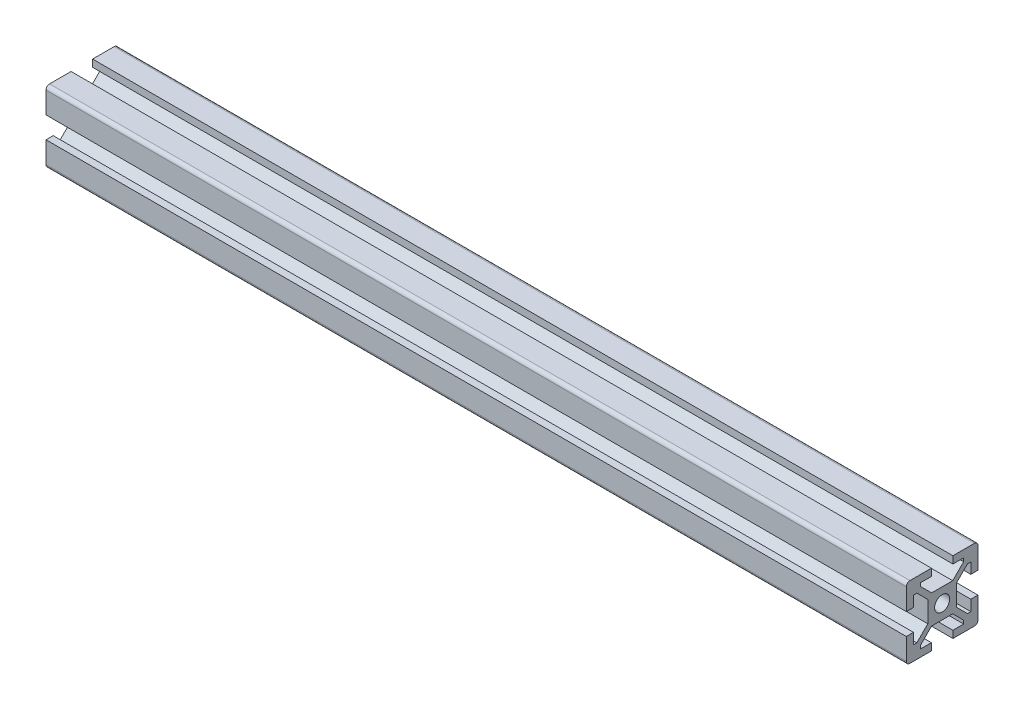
ISO-10303-21;
HEADER;
FILE_DESCRIPTION(('STEP AP214'),'2;1');
FILE_NAME('part.step','',(''),(''),'','','');
FILE_SCHEMA(('AUTOMOTIVE_DESIGN { 1 0 10303 214 1 1 1 1 }'));
ENDSEC;
DATA;
#1=APPLICATION_CONTEXT('core data for automotive mechanical design processes');
#2=APPLICATION_PROTOCOL_DEFINITION('international standard','automotive_design',2000,#1);
#3=PRODUCT_CONTEXT('',#1,'mechanical');
#4=PRODUCT('Part','Part','',(#3));
#5=PRODUCT_RELATED_PRODUCT_CATEGORY('part','',(#4));
#6=PRODUCT_DEFINITION_FORMATION('','',#4);
#7=PRODUCT_DEFINITION_CONTEXT('part definition',#1,'design');
#8=PRODUCT_DEFINITION('design','',#6,#7);
#9=PRODUCT_DEFINITION_SHAPE('','',#8);
#10=(LENGTH_UNIT() NAMED_UNIT(*) SI_UNIT(.MILLI.,.METRE.));
#11=(NAMED_UNIT(*) PLANE_ANGLE_UNIT() SI_UNIT($,.RADIAN.));
#12=(NAMED_UNIT(*) SI_UNIT($,.STERADIAN.) SOLID_ANGLE_UNIT());
#13=UNCERTAINTY_MEASURE_WITH_UNIT(LENGTH_MEASURE(1.E-05),#10,'distance_accuracy_value','');
#14=(GEOMETRIC_REPRESENTATION_CONTEXT(3) GLOBAL_UNCERTAINTY_ASSIGNED_CONTEXT((#13)) GLOBAL_UNIT_ASSIGNED_CONTEXT((#10,
#11,#12)) REPRESENTATION_CONTEXT('',''));
#15=CARTESIAN_POINT('',(0.,0.,0.));
#16=DIRECTION('',(0.,0.,1.));
#17=DIRECTION('',(1.,0.,0.));
#18=AXIS2_PLACEMENT_3D('',#15,#16,#17);
#19=CARTESIAN_POINT('',(240.,9.,9.));
#20=DIRECTION('',(1.,0.,0.));
#21=DIRECTION('',(0.,0.,-1.));
#22=AXIS2_PLACEMENT_3D('',#19,#20,#21);
#23=PLANE('',#22);
#24=CARTESIAN_POINT('',(240.,9.,9.));
#25=DIRECTION('',(1.,0.,0.));
#26=DIRECTION('',(0.,0.,-1.));
#27=AXIS2_PLACEMENT_3D('',#24,#25,#26);
#28=CIRCLE('',#27,1.);
#29=CARTESIAN_POINT('',(240.,10.,9.));
#30=VERTEX_POINT('',#29);
#31=CARTESIAN_POINT('',(240.,9.,10.));
#32=VERTEX_POINT('',#31);
#33=EDGE_CURVE('E467',#30,#32,#28,.T.);
#34=ORIENTED_EDGE('',*,*,#33,.T.);
#35=DIRECTION('',(0.,-1.,0.));
#36=VECTOR('',#35,1.);
#37=CARTESIAN_POINT('',(240.,9.,10.));
#38=LINE('',#37,#36);
#39=CARTESIAN_POINT('',(240.,3.,10.));
#40=VERTEX_POINT('',#39);
#41=EDGE_CURVE('E215',#32,#40,#38,.T.);
#42=ORIENTED_EDGE('',*,*,#41,.T.);
#43=DIRECTION('',(0.,0.,-1.));
#44=VECTOR('',#43,1.);
#45=CARTESIAN_POINT('',(240.,3.,10.));
#46=LINE('',#45,#44);
#47=CARTESIAN_POINT('',(240.,3.,8.));
#48=VERTEX_POINT('',#47);
#49=EDGE_CURVE('E602',#40,#48,#46,.T.);
#50=ORIENTED_EDGE('',*,*,#49,.T.);
#51=DIRECTION('',(0.,1.,0.));
#52=VECTOR('',#51,1.);
#53=CARTESIAN_POINT('',(240.,3.,8.));
#54=LINE('',#53,#52);
#55=CARTESIAN_POINT('',(240.,6.,8.));
#56=VERTEX_POINT('',#55);
#57=EDGE_CURVE('E621',#48,#56,#54,.T.);
#58=ORIENTED_EDGE('',*,*,#57,.T.);
#59=DIRECTION('',(0.,0.,-1.));
#60=VECTOR('',#59,1.);
#61=CARTESIAN_POINT('',(240.,6.,8.));
#62=LINE('',#61,#60);
#63=CARTESIAN_POINT('',(240.,6.,7.06066017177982));
#64=VERTEX_POINT('',#63);
#65=EDGE_CURVE('E618',#56,#64,#62,.T.);
#66=ORIENTED_EDGE('',*,*,#65,.T.);
#67=DIRECTION('',(0.,-0.707106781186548,-0.707106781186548));
#68=VECTOR('',#67,1.);
#69=CARTESIAN_POINT('',(240.,6.,7.06066017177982));
#70=LINE('',#69,#68);
#71=CARTESIAN_POINT('',(240.,2.93933982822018,4.));
#72=VERTEX_POINT('',#71);
#73=EDGE_CURVE('E620',#64,#72,#70,.T.);
#74=ORIENTED_EDGE('',*,*,#73,.T.);
#75=DIRECTION('',(0.,-1.,0.));
#76=VECTOR('',#75,1.);
#77=CARTESIAN_POINT('',(240.,2.93933982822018,4.));
#78=LINE('',#77,#76);
#79=CARTESIAN_POINT('',(240.,-2.93933982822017,4.));
#80=VERTEX_POINT('',#79);
#81=EDGE_CURVE('E623',#72,#80,#78,.T.);
#82=ORIENTED_EDGE('',*,*,#81,.T.);
#83=DIRECTION('',(0.,-0.707106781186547,0.707106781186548));
#84=VECTOR('',#83,1.);
#85=CARTESIAN_POINT('',(240.,-2.93933982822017,4.));
#86=LINE('',#85,#84);
#87=CARTESIAN_POINT('',(240.,-6.,7.06066017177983));
#88=VERTEX_POINT('',#87);
#89=EDGE_CURVE('E629',#80,#88,#86,.T.);
#90=ORIENTED_EDGE('',*,*,#89,.T.);
#91=DIRECTION('',(0.,0.,1.));
#92=VECTOR('',#91,1.);
#93=CARTESIAN_POINT('',(240.,-6.,7.06066017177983));
#94=LINE('',#93,#92);
#95=CARTESIAN_POINT('',(240.,-6.,7.99999999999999));
#96=VERTEX_POINT('',#95);
#97=EDGE_CURVE('E631',#88,#96,#94,.T.);
#98=ORIENTED_EDGE('',*,*,#97,.T.);
#99=DIRECTION('',(0.,1.,0.));
#100=VECTOR('',#99,1.);
#101=CARTESIAN_POINT('',(240.,-6.,7.99999999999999));
#102=LINE('',#101,#100);
#103=CARTESIAN_POINT('',(240.,-3.,7.99999999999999));
#104=VERTEX_POINT('',#103);
#105=EDGE_CURVE('E633',#96,#104,#102,.T.);
#106=ORIENTED_EDGE('',*,*,#105,.T.);
#107=DIRECTION('',(0.,0.,1.));
#108=VECTOR('',#107,1.);
#109=CARTESIAN_POINT('',(240.,-3.,7.99999999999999));
#110=LINE('',#109,#108);
#111=CARTESIAN_POINT('',(240.,-3.,10.));
#112=VERTEX_POINT('',#111);
#113=EDGE_CURVE('E635',#104,#112,#110,.T.);
#114=ORIENTED_EDGE('',*,*,#113,.T.);
#115=DIRECTION('',(0.,-1.,0.));
#116=VECTOR('',#115,1.);
#117=CARTESIAN_POINT('',(240.,-3.,10.));
#118=LINE('',#117,#116);
#119=CARTESIAN_POINT('',(240.,-9.,10.));
#120=VERTEX_POINT('',#119);
#121=EDGE_CURVE('E637',#112,#120,#118,.T.);
#122=ORIENTED_EDGE('',*,*,#121,.T.);
#123=CARTESIAN_POINT('',(240.,-9.,9.));
#124=DIRECTION('',(1.,0.,0.));
#125=DIRECTION('',(0.,0.,-1.));
#126=AXIS2_PLACEMENT_3D('',#123,#124,#125);
#127=CIRCLE('',#126,1.);
#128=CARTESIAN_POINT('',(240.,-10.,9.));
#129=VERTEX_POINT('',#128);
#130=EDGE_CURVE('E639',#120,#129,#127,.T.);
#131=ORIENTED_EDGE('',*,*,#130,.T.);
#132=DIRECTION('',(0.,0.,-1.));
#133=VECTOR('',#132,1.);
#134=CARTESIAN_POINT('',(240.,-10.,9.));
#135=LINE('',#134,#133);
#136=CARTESIAN_POINT('',(240.,-10.,3.));
#137=VERTEX_POINT('',#136);
#138=EDGE_CURVE('E641',#129,#137,#135,.T.);
#139=ORIENTED_EDGE('',*,*,#138,.T.);
#140=DIRECTION('',(0.,1.,0.));
#141=VECTOR('',#140,1.);
#142=CARTESIAN_POINT('',(240.,-10.,3.));
#143=LINE('',#142,#141);
#144=CARTESIAN_POINT('',(240.,-8.,3.));
#145=VERTEX_POINT('',#144);
#146=EDGE_CURVE('E643',#137,#145,#143,.T.);
#147=ORIENTED_EDGE('',*,*,#146,.T.);
#148=DIRECTION('',(0.,0.,1.));
#149=VECTOR('',#148,1.);
#150=CARTESIAN_POINT('',(240.,-8.,3.));
#151=LINE('',#150,#149);
#152=CARTESIAN_POINT('',(240.,-8.,6.));
#153=VERTEX_POINT('',#152);
#154=EDGE_CURVE('E645',#145,#153,#151,.T.);
#155=ORIENTED_EDGE('',*,*,#154,.T.);
#156=DIRECTION('',(0.,1.,0.));
#157=VECTOR('',#156,1.);
#158=CARTESIAN_POINT('',(240.,-8.,6.));
#159=LINE('',#158,#157);
#160=CARTESIAN_POINT('',(240.,-7.06066017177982,6.));
#161=VERTEX_POINT('',#160);
#162=EDGE_CURVE('E647',#153,#161,#159,.T.);
#163=ORIENTED_EDGE('',*,*,#162,.T.);
#164=DIRECTION('',(0.,0.707106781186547,-0.707106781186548));
#165=VECTOR('',#164,1.);
#166=CARTESIAN_POINT('',(240.,-7.06066017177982,6.));
#167=LINE('',#166,#165);
#168=CARTESIAN_POINT('',(240.,-4.,2.93933982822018));
#169=VERTEX_POINT('',#168);
#170=EDGE_CURVE('E649',#161,#169,#167,.T.);
#171=ORIENTED_EDGE('',*,*,#170,.T.);
#172=DIRECTION('',(0.,0.,-1.));
#173=VECTOR('',#172,1.);
#174=CARTESIAN_POINT('',(240.,-4.,2.93933982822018));
#175=LINE('',#174,#173);
#176=CARTESIAN_POINT('',(240.,-4.,-2.93933982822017));
#177=VERTEX_POINT('',#176);
#178=EDGE_CURVE('E651',#169,#177,#175,.T.);
#179=ORIENTED_EDGE('',*,*,#178,.T.);
#180=DIRECTION('',(0.,-0.707106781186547,-0.707106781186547));
#181=VECTOR('',#180,1.);
#182=CARTESIAN_POINT('',(240.,-4.,-2.93933982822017));
#183=LINE('',#182,#181);
#184=CARTESIAN_POINT('',(240.,-7.06066017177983,-6.));
#185=VERTEX_POINT('',#184);
#186=EDGE_CURVE('E653',#177,#185,#183,.T.);
#187=ORIENTED_EDGE('',*,*,#186,.T.);
#188=DIRECTION('',(0.,-1.,0.));
#189=VECTOR('',#188,1.);
#190=CARTESIAN_POINT('',(240.,-7.06066017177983,-6.));
#191=LINE('',#190,#189);
#192=CARTESIAN_POINT('',(240.,-7.99999999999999,-6.));
#193=VERTEX_POINT('',#192);
#194=EDGE_CURVE('E655',#185,#193,#191,.T.);
#195=ORIENTED_EDGE('',*,*,#194,.T.);
#196=DIRECTION('',(0.,0.,1.));
#197=VECTOR('',#196,1.);
#198=CARTESIAN_POINT('',(240.,-7.99999999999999,-6.));
#199=LINE('',#198,#197);
#200=CARTESIAN_POINT('',(240.,-7.99999999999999,-3.));
#201=VERTEX_POINT('',#200);
#202=EDGE_CURVE('E657',#193,#201,#199,.T.);
#203=ORIENTED_EDGE('',*,*,#202,.T.);
#204=DIRECTION('',(0.,-1.,0.));
#205=VECTOR('',#204,1.);
#206=CARTESIAN_POINT('',(240.,-7.99999999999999,-3.));
#207=LINE('',#206,#205);
#208=CARTESIAN_POINT('',(240.,-10.,-3.));
#209=VERTEX_POINT('',#208);
#210=EDGE_CURVE('E659',#201,#209,#207,.T.);
#211=ORIENTED_EDGE('',*,*,#210,.T.);
#212=DIRECTION('',(0.,0.,-1.));
#213=VECTOR('',#212,1.);
#214=CARTESIAN_POINT('',(240.,-10.,-3.));
#215=LINE('',#214,#213);
#216=CARTESIAN_POINT('',(240.,-10.,-9.00000000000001));
#217=VERTEX_POINT('',#216);
#218=EDGE_CURVE('E661',#209,#217,#215,.T.);
#219=ORIENTED_EDGE('',*,*,#218,.T.);
#220=CARTESIAN_POINT('',(240.,-9.,-9.00000000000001));
#221=DIRECTION('',(1.,0.,0.));
#222=DIRECTION('',(0.,0.,-1.));
#223=AXIS2_PLACEMENT_3D('',#220,#221,#222);
#224=CIRCLE('',#223,0.999999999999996);
#225=CARTESIAN_POINT('',(240.,-9.,-10.));
#226=VERTEX_POINT('',#225);
#227=EDGE_CURVE('E663',#217,#226,#224,.T.);
#228=ORIENTED_EDGE('',*,*,#227,.T.);
#229=DIRECTION('',(0.,1.,0.));
#230=VECTOR('',#229,1.);
#231=CARTESIAN_POINT('',(240.,-9.,-10.));
#232=LINE('',#231,#230);
#233=CARTESIAN_POINT('',(240.,-3.,-10.));
#234=VERTEX_POINT('',#233);
#235=EDGE_CURVE('E665',#226,#234,#232,.T.);
#236=ORIENTED_EDGE('',*,*,#235,.T.);
#237=DIRECTION('',(0.,0.,1.));
#238=VECTOR('',#237,1.);
#239=CARTESIAN_POINT('',(240.,-3.,-10.));
#240=LINE('',#239,#238);
#241=CARTESIAN_POINT('',(240.,-3.,-8.00000000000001));
#242=VERTEX_POINT('',#241);
#243=EDGE_CURVE('E667',#234,#242,#240,.T.);
#244=ORIENTED_EDGE('',*,*,#243,.T.);
#245=DIRECTION('',(0.,-1.,0.));
#246=VECTOR('',#245,1.);
#247=CARTESIAN_POINT('',(240.,-3.,-8.00000000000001));
#248=LINE('',#247,#246);
#249=CARTESIAN_POINT('',(240.,-6.,-8.00000000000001));
#250=VERTEX_POINT('',#249);
#251=EDGE_CURVE('E669',#242,#250,#248,.T.);
#252=ORIENTED_EDGE('',*,*,#251,.T.);
#253=DIRECTION('',(0.,0.,1.));
#254=VECTOR('',#253,1.);
#255=CARTESIAN_POINT('',(240.,-6.,-8.00000000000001));
#256=LINE('',#255,#254);
#257=CARTESIAN_POINT('',(240.,-6.,-7.06066017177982));
#258=VERTEX_POINT('',#257);
#259=EDGE_CURVE('E671',#250,#258,#256,.T.);
#260=ORIENTED_EDGE('',*,*,#259,.T.);
#261=DIRECTION('',(0.,0.707106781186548,0.707106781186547));
#262=VECTOR('',#261,1.);
#263=CARTESIAN_POINT('',(240.,-6.,-7.06066017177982));
#264=LINE('',#263,#262);
#265=CARTESIAN_POINT('',(240.,-2.93933982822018,-4.));
#266=VERTEX_POINT('',#265);
#267=EDGE_CURVE('E673',#258,#266,#264,.T.);
#268=ORIENTED_EDGE('',*,*,#267,.T.);
#269=DIRECTION('',(0.,1.,0.));
#270=VECTOR('',#269,1.);
#271=CARTESIAN_POINT('',(240.,-2.93933982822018,-4.));
#272=LINE('',#271,#270);
#273=CARTESIAN_POINT('',(240.,2.93933982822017,-4.));
#274=VERTEX_POINT('',#273);
#275=EDGE_CURVE('E675',#266,#274,#272,.T.);
#276=ORIENTED_EDGE('',*,*,#275,.T.);
#277=DIRECTION('',(0.,0.707106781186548,-0.707106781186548));
#278=VECTOR('',#277,1.);
#279=CARTESIAN_POINT('',(240.,2.93933982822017,-4.));
#280=LINE('',#279,#278);
#281=CARTESIAN_POINT('',(240.,6.,-7.06066017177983));
#282=VERTEX_POINT('',#281);
#283=EDGE_CURVE('E677',#274,#282,#280,.T.);
#284=ORIENTED_EDGE('',*,*,#283,.T.);
#285=DIRECTION('',(0.,0.,-1.));
#286=VECTOR('',#285,1.);
#287=CARTESIAN_POINT('',(240.,6.,-7.06066017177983));
#288=LINE('',#287,#286);
#289=CARTESIAN_POINT('',(240.,6.,-7.99999999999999));
#290=VERTEX_POINT('',#289);
#291=EDGE_CURVE('E679',#282,#290,#288,.T.);
#292=ORIENTED_EDGE('',*,*,#291,.T.);
#293=DIRECTION('',(0.,-1.,0.));
#294=VECTOR('',#293,1.);
#295=CARTESIAN_POINT('',(240.,6.,-7.99999999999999));
#296=LINE('',#295,#294);
#297=CARTESIAN_POINT('',(240.,3.,-7.99999999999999));
#298=VERTEX_POINT('',#297);
#299=EDGE_CURVE('E681',#290,#298,#296,.T.);
#300=ORIENTED_EDGE('',*,*,#299,.T.);
#301=DIRECTION('',(0.,0.,-1.));
#302=VECTOR('',#301,1.);
#303=CARTESIAN_POINT('',(240.,3.,-7.99999999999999));
#304=LINE('',#303,#302);
#305=CARTESIAN_POINT('',(240.,3.,-10.));
#306=VERTEX_POINT('',#305);
#307=EDGE_CURVE('E683',#298,#306,#304,.T.);
#308=ORIENTED_EDGE('',*,*,#307,.T.);
#309=DIRECTION('',(0.,1.,0.));
#310=VECTOR('',#309,1.);
#311=CARTESIAN_POINT('',(240.,3.,-10.));
#312=LINE('',#311,#310);
#313=CARTESIAN_POINT('',(240.,9.,-10.));
#314=VERTEX_POINT('',#313);
#315=EDGE_CURVE('E685',#306,#314,#312,.T.);
#316=ORIENTED_EDGE('',*,*,#315,.T.);
#317=CARTESIAN_POINT('',(240.,9.,-9.00000000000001));
#318=DIRECTION('',(1.,0.,0.));
#319=DIRECTION('',(0.,0.,-1.));
#320=AXIS2_PLACEMENT_3D('',#317,#318,#319);
#321=CIRCLE('',#320,1.);
#322=CARTESIAN_POINT('',(240.,10.,-9.00000000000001));
#323=VERTEX_POINT('',#322);
#324=EDGE_CURVE('E687',#314,#323,#321,.T.);
#325=ORIENTED_EDGE('',*,*,#324,.T.);
#326=DIRECTION('',(0.,0.,1.));
#327=VECTOR('',#326,1.);
#328=CARTESIAN_POINT('',(240.,10.,-9.00000000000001));
#329=LINE('',#328,#327);
#330=CARTESIAN_POINT('',(240.,10.,-3.));
#331=VERTEX_POINT('',#330);
#332=EDGE_CURVE('E689',#323,#331,#329,.T.);
#333=ORIENTED_EDGE('',*,*,#332,.T.);
#334=DIRECTION('',(0.,-1.,0.));
#335=VECTOR('',#334,1.);
#336=CARTESIAN_POINT('',(240.,10.,-3.));
#337=LINE('',#336,#335);
#338=CARTESIAN_POINT('',(240.,8.,-3.));
#339=VERTEX_POINT('',#338);
#340=EDGE_CURVE('E691',#331,#339,#337,.T.);
#341=ORIENTED_EDGE('',*,*,#340,.T.);
#342=DIRECTION('',(0.,0.,-1.));
#343=VECTOR('',#342,1.);
#344=CARTESIAN_POINT('',(240.,8.,-3.));
#345=LINE('',#344,#343);
#346=CARTESIAN_POINT('',(240.,8.,-6.));
#347=VERTEX_POINT('',#346);
#348=EDGE_CURVE('E693',#339,#347,#345,.T.);
#349=ORIENTED_EDGE('',*,*,#348,.T.);
#350=DIRECTION('',(0.,-1.,0.));
#351=VECTOR('',#350,1.);
#352=CARTESIAN_POINT('',(240.,8.,-6.));
#353=LINE('',#352,#351);
#354=CARTESIAN_POINT('',(240.,7.06066017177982,-6.));
#355=VERTEX_POINT('',#354);
#356=EDGE_CURVE('E695',#347,#355,#353,.T.);
#357=ORIENTED_EDGE('',*,*,#356,.T.);
#358=DIRECTION('',(0.,-0.707106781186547,0.707106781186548));
#359=VECTOR('',#358,1.);
#360=CARTESIAN_POINT('',(240.,7.06066017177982,-6.));
#361=LINE('',#360,#359);
#362=CARTESIAN_POINT('',(240.,4.,-2.93933982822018));
#363=VERTEX_POINT('',#362);
#364=EDGE_CURVE('E697',#355,#363,#361,.T.);
#365=ORIENTED_EDGE('',*,*,#364,.T.);
#366=DIRECTION('',(0.,0.,1.));
#367=VECTOR('',#366,1.);
#368=CARTESIAN_POINT('',(240.,4.,-2.93933982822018));
#369=LINE('',#368,#367);
#370=CARTESIAN_POINT('',(240.,4.,2.93933982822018));
#371=VERTEX_POINT('',#370);
#372=EDGE_CURVE('E699',#363,#371,#369,.T.);
#373=ORIENTED_EDGE('',*,*,#372,.T.);
#374=DIRECTION('',(0.,0.707106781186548,0.707106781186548));
#375=VECTOR('',#374,1.);
#376=CARTESIAN_POINT('',(240.,4.,2.93933982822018));
#377=LINE('',#376,#375);
#378=CARTESIAN_POINT('',(240.,7.06066017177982,6.));
#379=VERTEX_POINT('',#378);
#380=EDGE_CURVE('E701',#371,#379,#377,.T.);
#381=ORIENTED_EDGE('',*,*,#380,.T.);
#382=DIRECTION('',(0.,1.,0.));
#383=VECTOR('',#382,1.);
#384=CARTESIAN_POINT('',(240.,7.06066017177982,6.));
#385=LINE('',#384,#383);
#386=CARTESIAN_POINT('',(240.,7.99999999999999,6.));
#387=VERTEX_POINT('',#386);
#388=EDGE_CURVE('E354',#379,#387,#385,.T.);
#389=ORIENTED_EDGE('',*,*,#388,.T.);
#390=DIRECTION('',(0.,0.,-1.));
#391=VECTOR('',#390,1.);
#392=CARTESIAN_POINT('',(240.,7.99999999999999,6.));
#393=LINE('',#392,#391);
#394=CARTESIAN_POINT('',(240.,7.99999999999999,3.));
#395=VERTEX_POINT('',#394);
#396=EDGE_CURVE('E348',#387,#395,#393,.T.);
#397=ORIENTED_EDGE('',*,*,#396,.T.);
#398=DIRECTION('',(0.,1.,0.));
#399=VECTOR('',#398,1.);
#400=CARTESIAN_POINT('',(240.,7.99999999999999,3.));
#401=LINE('',#400,#399);
#402=CARTESIAN_POINT('',(240.,10.,3.));
#403=VERTEX_POINT('',#402);
#404=EDGE_CURVE('E352',#395,#403,#401,.T.);
#405=ORIENTED_EDGE('',*,*,#404,.T.);
#406=DIRECTION('',(0.,0.,1.));
#407=VECTOR('',#406,1.);
#408=CARTESIAN_POINT('',(240.,10.,3.));
#409=LINE('',#408,#407);
#410=EDGE_CURVE('E52',#403,#30,#409,.T.);
#411=ORIENTED_EDGE('',*,*,#410,.T.);
#412=EDGE_LOOP('',(#34,#42,#50,#58,#66,#74,#82,#90,#98,#106,#114,#122,#131,#139,#147,#155,#163,
#171,#179,#187,#195,#203,#211,#219,#228,#236,#244,#252,#260,#268,#276,#284,#292,#300,#308,#316,
#325,#333,#341,#349,#357,#365,#373,#381,#389,#397,#405,#411));
#413=FACE_BOUND('',#412,.T.);
#414=CARTESIAN_POINT('',(240.,0.,0.));
#415=DIRECTION('',(1.,0.,0.));
#416=DIRECTION('',(0.,0.,-1.));
#417=AXIS2_PLACEMENT_3D('',#414,#415,#416);
#418=CIRCLE('',#417,2.1);
#419=CARTESIAN_POINT('',(240.,0.,-2.1));
#420=VERTEX_POINT('',#419);
#421=EDGE_CURVE('E376',#420,#420,#418,.T.);
#422=ORIENTED_EDGE('',*,*,#421,.F.);
#423=EDGE_LOOP('',(#422));
#424=FACE_BOUND('',#423,.T.);
#425=ADVANCED_FACE('F35',(#413,#424),#23,.T.);
#426=CARTESIAN_POINT('',(0.,9.,9.));
#427=DIRECTION('',(1.,0.,0.));
#428=DIRECTION('',(0.,0.,-1.));
#429=AXIS2_PLACEMENT_3D('',#426,#427,#428);
#430=PLANE('',#429);
#431=CARTESIAN_POINT('',(0.,9.,9.));
#432=DIRECTION('',(1.,0.,0.));
#433=DIRECTION('',(0.,0.,-1.));
#434=AXIS2_PLACEMENT_3D('',#431,#432,#433);
#435=CIRCLE('',#434,1.);
#436=CARTESIAN_POINT('',(0.,10.,9.));
#437=VERTEX_POINT('',#436);
#438=CARTESIAN_POINT('',(0.,9.,10.));
#439=VERTEX_POINT('',#438);
#440=EDGE_CURVE('E372',#437,#439,#435,.T.);
#441=ORIENTED_EDGE('',*,*,#440,.F.);
#442=DIRECTION('',(0.,0.,1.));
#443=VECTOR('',#442,1.);
#444=CARTESIAN_POINT('',(0.,10.,3.));
#445=LINE('',#444,#443);
#446=CARTESIAN_POINT('',(0.,10.,3.));
#447=VERTEX_POINT('',#446);
#448=EDGE_CURVE('E207',#447,#437,#445,.T.);
#449=ORIENTED_EDGE('',*,*,#448,.F.);
#450=DIRECTION('',(0.,1.,0.));
#451=VECTOR('',#450,1.);
#452=CARTESIAN_POINT('',(0.,7.99999999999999,3.));
#453=LINE('',#452,#451);
#454=CARTESIAN_POINT('',(0.,7.99999999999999,3.));
#455=VERTEX_POINT('',#454);
#456=EDGE_CURVE('E201',#455,#447,#453,.T.);
#457=ORIENTED_EDGE('',*,*,#456,.F.);
#458=DIRECTION('',(0.,0.,-1.));
#459=VECTOR('',#458,1.);
#460=CARTESIAN_POINT('',(0.,7.99999999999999,6.));
#461=LINE('',#460,#459);
#462=CARTESIAN_POINT('',(0.,7.99999999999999,6.));
#463=VERTEX_POINT('',#462);
#464=EDGE_CURVE('E362',#463,#455,#461,.T.);
#465=ORIENTED_EDGE('',*,*,#464,.F.);
#466=DIRECTION('',(0.,1.,0.));
#467=VECTOR('',#466,1.);
#468=CARTESIAN_POINT('',(0.,7.06066017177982,6.));
#469=LINE('',#468,#467);
#470=CARTESIAN_POINT('',(0.,7.06066017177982,6.));
#471=VERTEX_POINT('',#470);
#472=EDGE_CURVE('E462',#471,#463,#469,.T.);
#473=ORIENTED_EDGE('',*,*,#472,.F.);
#474=DIRECTION('',(0.,0.707106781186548,0.707106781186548));
#475=VECTOR('',#474,1.);
#476=CARTESIAN_POINT('',(0.,4.,2.93933982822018));
#477=LINE('',#476,#475);
#478=CARTESIAN_POINT('',(0.,4.,2.93933982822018));
#479=VERTEX_POINT('',#478);
#480=EDGE_CURVE('E460',#479,#471,#477,.T.);
#481=ORIENTED_EDGE('',*,*,#480,.F.);
#482=DIRECTION('',(0.,0.,1.));
#483=VECTOR('',#482,1.);
#484=CARTESIAN_POINT('',(0.,4.,-2.93933982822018));
#485=LINE('',#484,#483);
#486=CARTESIAN_POINT('',(0.,4.,-2.93933982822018));
#487=VERTEX_POINT('',#486);
#488=EDGE_CURVE('E458',#487,#479,#485,.T.);
#489=ORIENTED_EDGE('',*,*,#488,.F.);
#490=DIRECTION('',(0.,-0.707106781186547,0.707106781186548));
#491=VECTOR('',#490,1.);
#492=CARTESIAN_POINT('',(0.,7.06066017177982,-6.));
#493=LINE('',#492,#491);
#494=CARTESIAN_POINT('',(0.,7.06066017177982,-6.));
#495=VERTEX_POINT('',#494);
#496=EDGE_CURVE('E456',#495,#487,#493,.T.);
#497=ORIENTED_EDGE('',*,*,#496,.F.);
#498=DIRECTION('',(0.,-1.,0.));
#499=VECTOR('',#498,1.);
#500=CARTESIAN_POINT('',(0.,8.,-6.));
#501=LINE('',#500,#499);
#502=CARTESIAN_POINT('',(0.,8.,-6.));
#503=VERTEX_POINT('',#502);
#504=EDGE_CURVE('E454',#503,#495,#501,.T.);
#505=ORIENTED_EDGE('',*,*,#504,.F.);
#506=DIRECTION('',(0.,0.,-1.));
#507=VECTOR('',#506,1.);
#508=CARTESIAN_POINT('',(0.,8.,-3.));
#509=LINE('',#508,#507);
#510=CARTESIAN_POINT('',(0.,8.,-3.));
#511=VERTEX_POINT('',#510);
#512=EDGE_CURVE('E452',#511,#503,#509,.T.);
#513=ORIENTED_EDGE('',*,*,#512,.F.);
#514=DIRECTION('',(0.,-1.,0.));
#515=VECTOR('',#514,1.);
#516=CARTESIAN_POINT('',(0.,10.,-3.));
#517=LINE('',#516,#515);
#518=CARTESIAN_POINT('',(0.,10.,-3.));
#519=VERTEX_POINT('',#518);
#520=EDGE_CURVE('E450',#519,#511,#517,.T.);
#521=ORIENTED_EDGE('',*,*,#520,.F.);
#522=DIRECTION('',(0.,0.,1.));
#523=VECTOR('',#522,1.);
#524=CARTESIAN_POINT('',(0.,10.,-9.00000000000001));
#525=LINE('',#524,#523);
#526=CARTESIAN_POINT('',(0.,10.,-9.00000000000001));
#527=VERTEX_POINT('',#526);
#528=EDGE_CURVE('E448',#527,#519,#525,.T.);
#529=ORIENTED_EDGE('',*,*,#528,.F.);
#530=CARTESIAN_POINT('',(0.,9.,-9.00000000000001));
#531=DIRECTION('',(1.,0.,0.));
#532=DIRECTION('',(0.,0.,-1.));
#533=AXIS2_PLACEMENT_3D('',#530,#531,#532);
#534=CIRCLE('',#533,1.);
#535=CARTESIAN_POINT('',(0.,9.,-10.));
#536=VERTEX_POINT('',#535);
#537=EDGE_CURVE('E446',#536,#527,#534,.T.);
#538=ORIENTED_EDGE('',*,*,#537,.F.);
#539=DIRECTION('',(0.,1.,0.));
#540=VECTOR('',#539,1.);
#541=CARTESIAN_POINT('',(0.,3.,-10.));
#542=LINE('',#541,#540);
#543=CARTESIAN_POINT('',(0.,3.,-10.));
#544=VERTEX_POINT('',#543);
#545=EDGE_CURVE('E444',#544,#536,#542,.T.);
#546=ORIENTED_EDGE('',*,*,#545,.F.);
#547=DIRECTION('',(0.,0.,-1.));
#548=VECTOR('',#547,1.);
#549=CARTESIAN_POINT('',(0.,3.,-7.99999999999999));
#550=LINE('',#549,#548);
#551=CARTESIAN_POINT('',(0.,3.,-7.99999999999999));
#552=VERTEX_POINT('',#551);
#553=EDGE_CURVE('E442',#552,#544,#550,.T.);
#554=ORIENTED_EDGE('',*,*,#553,.F.);
#555=DIRECTION('',(0.,-1.,0.));
#556=VECTOR('',#555,1.);
#557=CARTESIAN_POINT('',(0.,6.,-7.99999999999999));
#558=LINE('',#557,#556);
#559=CARTESIAN_POINT('',(0.,6.,-7.99999999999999));
#560=VERTEX_POINT('',#559);
#561=EDGE_CURVE('E440',#560,#552,#558,.T.);
#562=ORIENTED_EDGE('',*,*,#561,.F.);
#563=DIRECTION('',(0.,0.,-1.));
#564=VECTOR('',#563,1.);
#565=CARTESIAN_POINT('',(0.,6.,-7.06066017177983));
#566=LINE('',#565,#564);
#567=CARTESIAN_POINT('',(0.,6.,-7.06066017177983));
#568=VERTEX_POINT('',#567);
#569=EDGE_CURVE('E438',#568,#560,#566,.T.);
#570=ORIENTED_EDGE('',*,*,#569,.F.);
#571=DIRECTION('',(0.,0.707106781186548,-0.707106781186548));
#572=VECTOR('',#571,1.);
#573=CARTESIAN_POINT('',(0.,2.93933982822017,-4.));
#574=LINE('',#573,#572);
#575=CARTESIAN_POINT('',(0.,2.93933982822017,-4.));
#576=VERTEX_POINT('',#575);
#577=EDGE_CURVE('E436',#576,#568,#574,.T.);
#578=ORIENTED_EDGE('',*,*,#577,.F.);
#579=DIRECTION('',(0.,1.,0.));
#580=VECTOR('',#579,1.);
#581=CARTESIAN_POINT('',(0.,-2.93933982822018,-4.));
#582=LINE('',#581,#580);
#583=CARTESIAN_POINT('',(0.,-2.93933982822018,-4.));
#584=VERTEX_POINT('',#583);
#585=EDGE_CURVE('E434',#584,#576,#582,.T.);
#586=ORIENTED_EDGE('',*,*,#585,.F.);
#587=DIRECTION('',(0.,0.707106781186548,0.707106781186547));
#588=VECTOR('',#587,1.);
#589=CARTESIAN_POINT('',(0.,-6.,-7.06066017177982));
#590=LINE('',#589,#588);
#591=CARTESIAN_POINT('',(0.,-6.,-7.06066017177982));
#592=VERTEX_POINT('',#591);
#593=EDGE_CURVE('E432',#592,#584,#590,.T.);
#594=ORIENTED_EDGE('',*,*,#593,.F.);
#595=DIRECTION('',(0.,0.,1.));
#596=VECTOR('',#595,1.);
#597=CARTESIAN_POINT('',(0.,-6.,-8.00000000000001));
#598=LINE('',#597,#596);
#599=CARTESIAN_POINT('',(0.,-6.,-8.00000000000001));
#600=VERTEX_POINT('',#599);
#601=EDGE_CURVE('E430',#600,#592,#598,.T.);
#602=ORIENTED_EDGE('',*,*,#601,.F.);
#603=DIRECTION('',(0.,-1.,0.));
#604=VECTOR('',#603,1.);
#605=CARTESIAN_POINT('',(0.,-3.,-8.00000000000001));
#606=LINE('',#605,#604);
#607=CARTESIAN_POINT('',(0.,-3.,-8.00000000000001));
#608=VERTEX_POINT('',#607);
#609=EDGE_CURVE('E428',#608,#600,#606,.T.);
#610=ORIENTED_EDGE('',*,*,#609,.F.);
#611=DIRECTION('',(0.,0.,1.));
#612=VECTOR('',#611,1.);
#613=CARTESIAN_POINT('',(0.,-3.,-10.));
#614=LINE('',#613,#612);
#615=CARTESIAN_POINT('',(0.,-3.,-10.));
#616=VERTEX_POINT('',#615);
#617=EDGE_CURVE('E426',#616,#608,#614,.T.);
#618=ORIENTED_EDGE('',*,*,#617,.F.);
#619=DIRECTION('',(0.,1.,0.));
#620=VECTOR('',#619,1.);
#621=CARTESIAN_POINT('',(0.,-9.,-10.));
#622=LINE('',#621,#620);
#623=CARTESIAN_POINT('',(0.,-9.,-10.));
#624=VERTEX_POINT('',#623);
#625=EDGE_CURVE('E424',#624,#616,#622,.T.);
#626=ORIENTED_EDGE('',*,*,#625,.F.);
#627=CARTESIAN_POINT('',(0.,-9.,-9.00000000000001));
#628=DIRECTION('',(1.,0.,0.));
#629=DIRECTION('',(0.,0.,-1.));
#630=AXIS2_PLACEMENT_3D('',#627,#628,#629);
#631=CIRCLE('',#630,0.999999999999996);
#632=CARTESIAN_POINT('',(0.,-10.,-9.00000000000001));
#633=VERTEX_POINT('',#632);
#634=EDGE_CURVE('E422',#633,#624,#631,.T.);
#635=ORIENTED_EDGE('',*,*,#634,.F.);
#636=DIRECTION('',(0.,0.,-1.));
#637=VECTOR('',#636,1.);
#638=CARTESIAN_POINT('',(0.,-10.,-3.));
#639=LINE('',#638,#637);
#640=CARTESIAN_POINT('',(0.,-10.,-3.));
#641=VERTEX_POINT('',#640);
#642=EDGE_CURVE('E420',#641,#633,#639,.T.);
#643=ORIENTED_EDGE('',*,*,#642,.F.);
#644=DIRECTION('',(0.,-1.,0.));
#645=VECTOR('',#644,1.);
#646=CARTESIAN_POINT('',(0.,-7.99999999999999,-3.));
#647=LINE('',#646,#645);
#648=CARTESIAN_POINT('',(0.,-7.99999999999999,-3.));
#649=VERTEX_POINT('',#648);
#650=EDGE_CURVE('E418',#649,#641,#647,.T.);
#651=ORIENTED_EDGE('',*,*,#650,.F.);
#652=DIRECTION('',(0.,0.,1.));
#653=VECTOR('',#652,1.);
#654=CARTESIAN_POINT('',(0.,-7.99999999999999,-6.));
#655=LINE('',#654,#653);
#656=CARTESIAN_POINT('',(0.,-7.99999999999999,-6.));
#657=VERTEX_POINT('',#656);
#658=EDGE_CURVE('E416',#657,#649,#655,.T.);
#659=ORIENTED_EDGE('',*,*,#658,.F.);
#660=DIRECTION('',(0.,-1.,0.));
#661=VECTOR('',#660,1.);
#662=CARTESIAN_POINT('',(0.,-7.06066017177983,-6.));
#663=LINE('',#662,#661);
#664=CARTESIAN_POINT('',(0.,-7.06066017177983,-6.));
#665=VERTEX_POINT('',#664);
#666=EDGE_CURVE('E414',#665,#657,#663,.T.);
#667=ORIENTED_EDGE('',*,*,#666,.F.);
#668=DIRECTION('',(0.,-0.707106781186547,-0.707106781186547));
#669=VECTOR('',#668,1.);
#670=CARTESIAN_POINT('',(0.,-4.,-2.93933982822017));
#671=LINE('',#670,#669);
#672=CARTESIAN_POINT('',(0.,-4.,-2.93933982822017));
#673=VERTEX_POINT('',#672);
#674=EDGE_CURVE('E412',#673,#665,#671,.T.);
#675=ORIENTED_EDGE('',*,*,#674,.F.);
#676=DIRECTION('',(0.,0.,-1.));
#677=VECTOR('',#676,1.);
#678=CARTESIAN_POINT('',(0.,-4.,2.93933982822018));
#679=LINE('',#678,#677);
#680=CARTESIAN_POINT('',(0.,-4.,2.93933982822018));
#681=VERTEX_POINT('',#680);
#682=EDGE_CURVE('E410',#681,#673,#679,.T.);
#683=ORIENTED_EDGE('',*,*,#682,.F.);
#684=DIRECTION('',(0.,0.707106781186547,-0.707106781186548));
#685=VECTOR('',#684,1.);
#686=CARTESIAN_POINT('',(0.,-7.06066017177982,6.));
#687=LINE('',#686,#685);
#688=CARTESIAN_POINT('',(0.,-7.06066017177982,6.));
#689=VERTEX_POINT('',#688);
#690=EDGE_CURVE('E408',#689,#681,#687,.T.);
#691=ORIENTED_EDGE('',*,*,#690,.F.);
#692=DIRECTION('',(0.,1.,0.));
#693=VECTOR('',#692,1.);
#694=CARTESIAN_POINT('',(0.,-8.,6.));
#695=LINE('',#694,#693);
#696=CARTESIAN_POINT('',(0.,-8.,6.));
#697=VERTEX_POINT('',#696);
#698=EDGE_CURVE('E406',#697,#689,#695,.T.);
#699=ORIENTED_EDGE('',*,*,#698,.F.);
#700=DIRECTION('',(0.,0.,1.));
#701=VECTOR('',#700,1.);
#702=CARTESIAN_POINT('',(0.,-8.,3.));
#703=LINE('',#702,#701);
#704=CARTESIAN_POINT('',(0.,-8.,3.));
#705=VERTEX_POINT('',#704);
#706=EDGE_CURVE('E404',#705,#697,#703,.T.);
#707=ORIENTED_EDGE('',*,*,#706,.F.);
#708=DIRECTION('',(0.,1.,0.));
#709=VECTOR('',#708,1.);
#710=CARTESIAN_POINT('',(0.,-10.,3.));
#711=LINE('',#710,#709);
#712=CARTESIAN_POINT('',(0.,-10.,3.));
#713=VERTEX_POINT('',#712);
#714=EDGE_CURVE('E402',#713,#705,#711,.T.);
#715=ORIENTED_EDGE('',*,*,#714,.F.);
#716=DIRECTION('',(0.,0.,-1.));
#717=VECTOR('',#716,1.);
#718=CARTESIAN_POINT('',(0.,-10.,9.));
#719=LINE('',#718,#717);
#720=CARTESIAN_POINT('',(0.,-10.,9.));
#721=VERTEX_POINT('',#720);
#722=EDGE_CURVE('E400',#721,#713,#719,.T.);
#723=ORIENTED_EDGE('',*,*,#722,.F.);
#724=CARTESIAN_POINT('',(0.,-9.,9.));
#725=DIRECTION('',(1.,0.,0.));
#726=DIRECTION('',(0.,0.,-1.));
#727=AXIS2_PLACEMENT_3D('',#724,#725,#726);
#728=CIRCLE('',#727,1.);
#729=CARTESIAN_POINT('',(0.,-9.,10.));
#730=VERTEX_POINT('',#729);
#731=EDGE_CURVE('E398',#730,#721,#728,.T.);
#732=ORIENTED_EDGE('',*,*,#731,.F.);
#733=DIRECTION('',(0.,-1.,0.));
#734=VECTOR('',#733,1.);
#735=CARTESIAN_POINT('',(0.,-3.,10.));
#736=LINE('',#735,#734);
#737=CARTESIAN_POINT('',(0.,-3.,10.));
#738=VERTEX_POINT('',#737);
#739=EDGE_CURVE('E396',#738,#730,#736,.T.);
#740=ORIENTED_EDGE('',*,*,#739,.F.);
#741=DIRECTION('',(0.,0.,1.));
#742=VECTOR('',#741,1.);
#743=CARTESIAN_POINT('',(0.,-3.,7.99999999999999));
#744=LINE('',#743,#742);
#745=CARTESIAN_POINT('',(0.,-3.,7.99999999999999));
#746=VERTEX_POINT('',#745);
#747=EDGE_CURVE('E394',#746,#738,#744,.T.);
#748=ORIENTED_EDGE('',*,*,#747,.F.);
#749=DIRECTION('',(0.,1.,0.));
#750=VECTOR('',#749,1.);
#751=CARTESIAN_POINT('',(0.,-6.,7.99999999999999));
#752=LINE('',#751,#750);
#753=CARTESIAN_POINT('',(0.,-6.,7.99999999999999));
#754=VERTEX_POINT('',#753);
#755=EDGE_CURVE('E392',#754,#746,#752,.T.);
#756=ORIENTED_EDGE('',*,*,#755,.F.);
#757=DIRECTION('',(0.,0.,1.));
#758=VECTOR('',#757,1.);
#759=CARTESIAN_POINT('',(0.,-6.,7.06066017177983));
#760=LINE('',#759,#758);
#761=CARTESIAN_POINT('',(0.,-6.,7.06066017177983));
#762=VERTEX_POINT('',#761);
#763=EDGE_CURVE('E390',#762,#754,#760,.T.);
#764=ORIENTED_EDGE('',*,*,#763,.F.);
#765=DIRECTION('',(0.,-0.707106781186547,0.707106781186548));
#766=VECTOR('',#765,1.);
#767=CARTESIAN_POINT('',(0.,-2.93933982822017,4.));
#768=LINE('',#767,#766);
#769=CARTESIAN_POINT('',(0.,-2.93933982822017,4.));
#770=VERTEX_POINT('',#769);
#771=EDGE_CURVE('E388',#770,#762,#768,.T.);
#772=ORIENTED_EDGE('',*,*,#771,.F.);
#773=DIRECTION('',(0.,-1.,0.));
#774=VECTOR('',#773,1.);
#775=CARTESIAN_POINT('',(0.,2.93933982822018,4.));
#776=LINE('',#775,#774);
#777=CARTESIAN_POINT('',(0.,2.93933982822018,4.));
#778=VERTEX_POINT('',#777);
#779=EDGE_CURVE('E386',#778,#770,#776,.T.);
#780=ORIENTED_EDGE('',*,*,#779,.F.);
#781=DIRECTION('',(0.,-0.707106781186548,-0.707106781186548));
#782=VECTOR('',#781,1.);
#783=CARTESIAN_POINT('',(0.,6.,7.06066017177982));
#784=LINE('',#783,#782);
#785=CARTESIAN_POINT('',(0.,6.,7.06066017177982));
#786=VERTEX_POINT('',#785);
#787=EDGE_CURVE('E384',#786,#778,#784,.T.);
#788=ORIENTED_EDGE('',*,*,#787,.F.);
#789=DIRECTION('',(0.,0.,-1.));
#790=VECTOR('',#789,1.);
#791=CARTESIAN_POINT('',(0.,6.,8.));
#792=LINE('',#791,#790);
#793=CARTESIAN_POINT('',(0.,6.,8.));
#794=VERTEX_POINT('',#793);
#795=EDGE_CURVE('E382',#794,#786,#792,.T.);
#796=ORIENTED_EDGE('',*,*,#795,.F.);
#797=DIRECTION('',(0.,1.,0.));
#798=VECTOR('',#797,1.);
#799=CARTESIAN_POINT('',(0.,3.,8.));
#800=LINE('',#799,#798);
#801=CARTESIAN_POINT('',(0.,3.,8.));
#802=VERTEX_POINT('',#801);
#803=EDGE_CURVE('E380',#802,#794,#800,.T.);
#804=ORIENTED_EDGE('',*,*,#803,.F.);
#805=DIRECTION('',(0.,0.,-1.));
#806=VECTOR('',#805,1.);
#807=CARTESIAN_POINT('',(0.,3.,10.));
#808=LINE('',#807,#806);
#809=CARTESIAN_POINT('',(0.,3.,10.));
#810=VERTEX_POINT('',#809);
#811=EDGE_CURVE('E378',#810,#802,#808,.T.);
#812=ORIENTED_EDGE('',*,*,#811,.F.);
#813=DIRECTION('',(0.,-1.,0.));
#814=VECTOR('',#813,1.);
#815=CARTESIAN_POINT('',(0.,9.,10.));
#816=LINE('',#815,#814);
#817=EDGE_CURVE('E375',#439,#810,#816,.T.);
#818=ORIENTED_EDGE('',*,*,#817,.F.);
#819=EDGE_LOOP('',(#441,#449,#457,#465,#473,#481,#489,#497,#505,#513,#521,#529,#538,#546,#554,
#562,#570,#578,#586,#594,#602,#610,#618,#626,#635,#643,#651,#659,#667,#675,#683,#691,#699,#707,
#715,#723,#732,#740,#748,#756,#764,#772,#780,#788,#796,#804,#812,#818));
#820=FACE_BOUND('',#819,.T.);
#821=CARTESIAN_POINT('',(0.,0.,0.));
#822=DIRECTION('',(1.,0.,0.));
#823=DIRECTION('',(0.,0.,-1.));
#824=AXIS2_PLACEMENT_3D('',#821,#822,#823);
#825=CIRCLE('',#824,2.1);
#826=CARTESIAN_POINT('',(0.,0.,-2.1));
#827=VERTEX_POINT('',#826);
#828=EDGE_CURVE('E1328',#827,#827,#825,.T.);
#829=ORIENTED_EDGE('',*,*,#828,.T.);
#830=EDGE_LOOP('',(#829));
#831=FACE_BOUND('',#830,.T.);
#832=ADVANCED_FACE('F606',(#820,#831),#430,.F.);
#833=CARTESIAN_POINT('',(240.,9.,9.));
#834=DIRECTION('',(-1.,0.,0.));
#835=DIRECTION('',(0.,0.,1.));
#836=AXIS2_PLACEMENT_3D('',#833,#834,#835);
#837=CYLINDRICAL_SURFACE('',#836,1.);
#838=ORIENTED_EDGE('',*,*,#440,.T.);
#839=DIRECTION('',(-1.,0.,0.));
#840=VECTOR('',#839,1.);
#841=CARTESIAN_POINT('',(240.,9.,10.));
#842=LINE('',#841,#840);
#843=EDGE_CURVE('E11',#32,#439,#842,.T.);
#844=ORIENTED_EDGE('',*,*,#843,.F.);
#845=ORIENTED_EDGE('',*,*,#33,.F.);
#846=DIRECTION('',(-1.,0.,0.));
#847=VECTOR('',#846,1.);
#848=CARTESIAN_POINT('',(240.,10.,9.));
#849=LINE('',#848,#847);
#850=EDGE_CURVE('E368',#30,#437,#849,.T.);
#851=ORIENTED_EDGE('',*,*,#850,.T.);
#852=EDGE_LOOP('',(#838,#844,#845,#851));
#853=FACE_BOUND('',#852,.T.);
#854=ADVANCED_FACE('F37',(#853),#837,.T.);
#855=CARTESIAN_POINT('',(240.,9.,10.));
#856=DIRECTION('',(0.,0.,-1.));
#857=DIRECTION('',(-1.,0.,0.));
#858=AXIS2_PLACEMENT_3D('',#855,#856,#857);
#859=PLANE('',#858);
#860=ORIENTED_EDGE('',*,*,#817,.T.);
#861=DIRECTION('',(-1.,0.,0.));
#862=VECTOR('',#861,1.);
#863=CARTESIAN_POINT('',(240.,3.,10.));
#864=LINE('',#863,#862);
#865=EDGE_CURVE('E44',#40,#810,#864,.T.);
#866=ORIENTED_EDGE('',*,*,#865,.F.);
#867=ORIENTED_EDGE('',*,*,#41,.F.);
#868=ORIENTED_EDGE('',*,*,#843,.T.);
#869=EDGE_LOOP('',(#860,#866,#867,#868));
#870=FACE_BOUND('',#869,.T.);
#871=ADVANCED_FACE('F735',(#870),#859,.F.);
#872=CARTESIAN_POINT('',(240.,3.,10.));
#873=DIRECTION('',(0.,1.,0.));
#874=DIRECTION('',(0.,0.,1.));
#875=AXIS2_PLACEMENT_3D('',#872,#873,#874);
#876=PLANE('',#875);
#877=ORIENTED_EDGE('',*,*,#811,.T.);
#878=DIRECTION('',(-1.,0.,0.));
#879=VECTOR('',#878,1.);
#880=CARTESIAN_POINT('',(240.,3.,8.));
#881=LINE('',#880,#879);
#882=EDGE_CURVE('E594',#48,#802,#881,.T.);
#883=ORIENTED_EDGE('',*,*,#882,.F.);
#884=ORIENTED_EDGE('',*,*,#49,.F.);
#885=ORIENTED_EDGE('',*,*,#865,.T.);
#886=EDGE_LOOP('',(#877,#883,#884,#885));
#887=FACE_BOUND('',#886,.T.);
#888=ADVANCED_FACE('F600',(#887),#876,.F.);
#889=CARTESIAN_POINT('',(240.,3.,8.));
#890=DIRECTION('',(0.,0.,1.));
#891=DIRECTION('',(1.,0.,0.));
#892=AXIS2_PLACEMENT_3D('',#889,#890,#891);
#893=PLANE('',#892);
#894=ORIENTED_EDGE('',*,*,#803,.T.);
#895=DIRECTION('',(-1.,0.,0.));
#896=VECTOR('',#895,1.);
#897=CARTESIAN_POINT('',(240.,6.,8.));
#898=LINE('',#897,#896);
#899=EDGE_CURVE('E591',#56,#794,#898,.T.);
#900=ORIENTED_EDGE('',*,*,#899,.F.);
#901=ORIENTED_EDGE('',*,*,#57,.F.);
#902=ORIENTED_EDGE('',*,*,#882,.T.);
#903=EDGE_LOOP('',(#894,#900,#901,#902));
#904=FACE_BOUND('',#903,.T.);
#905=ADVANCED_FACE('F612',(#904),#893,.F.);
#906=CARTESIAN_POINT('',(240.,6.,8.));
#907=DIRECTION('',(0.,1.,0.));
#908=DIRECTION('',(0.,0.,1.));
#909=AXIS2_PLACEMENT_3D('',#906,#907,#908);
#910=PLANE('',#909);
#911=ORIENTED_EDGE('',*,*,#795,.T.);
#912=DIRECTION('',(-1.,0.,0.));
#913=VECTOR('',#912,1.);
#914=CARTESIAN_POINT('',(240.,6.,7.06066017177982));
#915=LINE('',#914,#913);
#916=EDGE_CURVE('E588',#64,#786,#915,.T.);
#917=ORIENTED_EDGE('',*,*,#916,.F.);
#918=ORIENTED_EDGE('',*,*,#65,.F.);
#919=ORIENTED_EDGE('',*,*,#899,.T.);
#920=EDGE_LOOP('',(#911,#917,#918,#919));
#921=FACE_BOUND('',#920,.T.);
#922=ADVANCED_FACE('F616',(#921),#910,.F.);
#923=CARTESIAN_POINT('',(240.,6.,7.06066017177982));
#924=DIRECTION('',(0.,0.707106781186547,-0.707106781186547));
#925=DIRECTION('',(0.,0.707106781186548,0.707106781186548));
#926=AXIS2_PLACEMENT_3D('',#923,#924,#925);
#927=PLANE('',#926);
#928=ORIENTED_EDGE('',*,*,#787,.T.);
#929=DIRECTION('',(-1.,0.,0.));
#930=VECTOR('',#929,1.);
#931=CARTESIAN_POINT('',(240.,2.93933982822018,4.));
#932=LINE('',#931,#930);
#933=EDGE_CURVE('E585',#72,#778,#932,.T.);
#934=ORIENTED_EDGE('',*,*,#933,.F.);
#935=ORIENTED_EDGE('',*,*,#73,.F.);
#936=ORIENTED_EDGE('',*,*,#916,.T.);
#937=EDGE_LOOP('',(#928,#934,#935,#936));
#938=FACE_BOUND('',#937,.T.);
#939=ADVANCED_FACE('F748',(#938),#927,.F.);
#940=CARTESIAN_POINT('',(240.,2.93933982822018,4.));
#941=DIRECTION('',(0.,0.,-1.));
#942=DIRECTION('',(-1.,0.,0.));
#943=AXIS2_PLACEMENT_3D('',#940,#941,#942);
#944=PLANE('',#943);
#945=ORIENTED_EDGE('',*,*,#779,.T.);
#946=DIRECTION('',(-1.,0.,0.));
#947=VECTOR('',#946,1.);
#948=CARTESIAN_POINT('',(240.,-2.93933982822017,4.));
#949=LINE('',#948,#947);
#950=EDGE_CURVE('E582',#80,#770,#949,.T.);
#951=ORIENTED_EDGE('',*,*,#950,.F.);
#952=ORIENTED_EDGE('',*,*,#81,.F.);
#953=ORIENTED_EDGE('',*,*,#933,.T.);
#954=EDGE_LOOP('',(#945,#951,#952,#953));
#955=FACE_BOUND('',#954,.T.);
#956=ADVANCED_FACE('F751',(#955),#944,.F.);
#957=CARTESIAN_POINT('',(240.,-2.93933982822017,4.));
#958=DIRECTION('',(0.,-0.707106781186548,-0.707106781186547));
#959=DIRECTION('',(0.,0.707106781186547,-0.707106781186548));
#960=AXIS2_PLACEMENT_3D('',#957,#958,#959);
#961=PLANE('',#960);
#962=ORIENTED_EDGE('',*,*,#771,.T.);
#963=DIRECTION('',(-1.,0.,0.));
#964=VECTOR('',#963,1.);
#965=CARTESIAN_POINT('',(240.,-6.,7.06066017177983));
#966=LINE('',#965,#964);
#967=EDGE_CURVE('E579',#88,#762,#966,.T.);
#968=ORIENTED_EDGE('',*,*,#967,.F.);
#969=ORIENTED_EDGE('',*,*,#89,.F.);
#970=ORIENTED_EDGE('',*,*,#950,.T.);
#971=EDGE_LOOP('',(#962,#968,#969,#970));
#972=FACE_BOUND('',#971,.T.);
#973=ADVANCED_FACE('F755',(#972),#961,.F.);
#974=CARTESIAN_POINT('',(240.,-6.,7.06066017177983));
#975=DIRECTION('',(0.,-1.,0.));
#976=DIRECTION('',(0.,0.,-1.));
#977=AXIS2_PLACEMENT_3D('',#974,#975,#976);
#978=PLANE('',#977);
#979=ORIENTED_EDGE('',*,*,#763,.T.);
#980=DIRECTION('',(-1.,0.,0.));
#981=VECTOR('',#980,1.);
#982=CARTESIAN_POINT('',(240.,-6.,7.99999999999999));
#983=LINE('',#982,#981);
#984=EDGE_CURVE('E576',#96,#754,#983,.T.);
#985=ORIENTED_EDGE('',*,*,#984,.F.);
#986=ORIENTED_EDGE('',*,*,#97,.F.);
#987=ORIENTED_EDGE('',*,*,#967,.T.);
#988=EDGE_LOOP('',(#979,#985,#986,#987));
#989=FACE_BOUND('',#988,.T.);
#990=ADVANCED_FACE('F759',(#989),#978,.F.);
#991=CARTESIAN_POINT('',(240.,-6.,7.99999999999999));
#992=DIRECTION('',(0.,0.,1.));
#993=DIRECTION('',(1.,0.,0.));
#994=AXIS2_PLACEMENT_3D('',#991,#992,#993);
#995=PLANE('',#994);
#996=ORIENTED_EDGE('',*,*,#755,.T.);
#997=DIRECTION('',(-1.,0.,0.));
#998=VECTOR('',#997,1.);
#999=CARTESIAN_POINT('',(240.,-3.,7.99999999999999));
#1000=LINE('',#999,#998);
#1001=EDGE_CURVE('E573',#104,#746,#1000,.T.);
#1002=ORIENTED_EDGE('',*,*,#1001,.F.);
#1003=ORIENTED_EDGE('',*,*,#105,.F.);
#1004=ORIENTED_EDGE('',*,*,#984,.T.);
#1005=EDGE_LOOP('',(#996,#1002,#1003,#1004));
#1006=FACE_BOUND('',#1005,.T.);
#1007=ADVANCED_FACE('F763',(#1006),#995,.F.);
#1008=CARTESIAN_POINT('',(240.,-3.,7.99999999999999));
#1009=DIRECTION('',(0.,-1.,0.));
#1010=DIRECTION('',(0.,0.,-1.));
#1011=AXIS2_PLACEMENT_3D('',#1008,#1009,#1010);
#1012=PLANE('',#1011);
#1013=ORIENTED_EDGE('',*,*,#747,.T.);
#1014=DIRECTION('',(-1.,0.,0.));
#1015=VECTOR('',#1014,1.);
#1016=CARTESIAN_POINT('',(240.,-3.,10.));
#1017=LINE('',#1016,#1015);
#1018=EDGE_CURVE('E570',#112,#738,#1017,.T.);
#1019=ORIENTED_EDGE('',*,*,#1018,.F.);
#1020=ORIENTED_EDGE('',*,*,#113,.F.);
#1021=ORIENTED_EDGE('',*,*,#1001,.T.);
#1022=EDGE_LOOP('',(#1013,#1019,#1020,#1021));
#1023=FACE_BOUND('',#1022,.T.);
#1024=ADVANCED_FACE('F767',(#1023),#1012,.F.);
#1025=CARTESIAN_POINT('',(240.,-3.,10.));
#1026=DIRECTION('',(0.,0.,-1.));
#1027=DIRECTION('',(-1.,0.,0.));
#1028=AXIS2_PLACEMENT_3D('',#1025,#1026,#1027);
#1029=PLANE('',#1028);
#1030=ORIENTED_EDGE('',*,*,#739,.T.);
#1031=DIRECTION('',(-1.,0.,0.));
#1032=VECTOR('',#1031,1.);
#1033=CARTESIAN_POINT('',(240.,-9.,10.));
#1034=LINE('',#1033,#1032);
#1035=EDGE_CURVE('E567',#120,#730,#1034,.T.);
#1036=ORIENTED_EDGE('',*,*,#1035,.F.);
#1037=ORIENTED_EDGE('',*,*,#121,.F.);
#1038=ORIENTED_EDGE('',*,*,#1018,.T.);
#1039=EDGE_LOOP('',(#1030,#1036,#1037,#1038));
#1040=FACE_BOUND('',#1039,.T.);
#1041=ADVANCED_FACE('F771',(#1040),#1029,.F.);
#1042=CARTESIAN_POINT('',(240.,-9.,9.));
#1043=DIRECTION('',(-1.,0.,0.));
#1044=DIRECTION('',(0.,0.,1.));
#1045=AXIS2_PLACEMENT_3D('',#1042,#1043,#1044);
#1046=CYLINDRICAL_SURFACE('',#1045,1.);
#1047=ORIENTED_EDGE('',*,*,#731,.T.);
#1048=DIRECTION('',(-1.,0.,0.));
#1049=VECTOR('',#1048,1.);
#1050=CARTESIAN_POINT('',(240.,-10.,9.));
#1051=LINE('',#1050,#1049);
#1052=EDGE_CURVE('E564',#129,#721,#1051,.T.);
#1053=ORIENTED_EDGE('',*,*,#1052,.F.);
#1054=ORIENTED_EDGE('',*,*,#130,.F.);
#1055=ORIENTED_EDGE('',*,*,#1035,.T.);
#1056=EDGE_LOOP('',(#1047,#1053,#1054,#1055));
#1057=FACE_BOUND('',#1056,.T.);
#1058=ADVANCED_FACE('F775',(#1057),#1046,.T.);
#1059=CARTESIAN_POINT('',(240.,-10.,9.));
#1060=DIRECTION('',(0.,1.,0.));
#1061=DIRECTION('',(0.,0.,1.));
#1062=AXIS2_PLACEMENT_3D('',#1059,#1060,#1061);
#1063=PLANE('',#1062);
#1064=ORIENTED_EDGE('',*,*,#722,.T.);
#1065=DIRECTION('',(-1.,0.,0.));
#1066=VECTOR('',#1065,1.);
#1067=CARTESIAN_POINT('',(240.,-10.,3.));
#1068=LINE('',#1067,#1066);
#1069=EDGE_CURVE('E561',#137,#713,#1068,.T.);
#1070=ORIENTED_EDGE('',*,*,#1069,.F.);
#1071=ORIENTED_EDGE('',*,*,#138,.F.);
#1072=ORIENTED_EDGE('',*,*,#1052,.T.);
#1073=EDGE_LOOP('',(#1064,#1070,#1071,#1072));
#1074=FACE_BOUND('',#1073,.T.);
#1075=ADVANCED_FACE('F779',(#1074),#1063,.F.);
#1076=CARTESIAN_POINT('',(240.,-10.,3.));
#1077=DIRECTION('',(0.,0.,1.));
#1078=DIRECTION('',(1.,0.,0.));
#1079=AXIS2_PLACEMENT_3D('',#1076,#1077,#1078);
#1080=PLANE('',#1079);
#1081=ORIENTED_EDGE('',*,*,#714,.T.);
#1082=DIRECTION('',(-1.,0.,0.));
#1083=VECTOR('',#1082,1.);
#1084=CARTESIAN_POINT('',(240.,-8.,3.));
#1085=LINE('',#1084,#1083);
#1086=EDGE_CURVE('E558',#145,#705,#1085,.T.);
#1087=ORIENTED_EDGE('',*,*,#1086,.F.);
#1088=ORIENTED_EDGE('',*,*,#146,.F.);
#1089=ORIENTED_EDGE('',*,*,#1069,.T.);
#1090=EDGE_LOOP('',(#1081,#1087,#1088,#1089));
#1091=FACE_BOUND('',#1090,.T.);
#1092=ADVANCED_FACE('F783',(#1091),#1080,.F.);
#1093=CARTESIAN_POINT('',(240.,-8.,3.));
#1094=DIRECTION('',(0.,-1.,0.));
#1095=DIRECTION('',(0.,0.,-1.));
#1096=AXIS2_PLACEMENT_3D('',#1093,#1094,#1095);
#1097=PLANE('',#1096);
#1098=ORIENTED_EDGE('',*,*,#706,.T.);
#1099=DIRECTION('',(-1.,0.,0.));
#1100=VECTOR('',#1099,1.);
#1101=CARTESIAN_POINT('',(240.,-8.,6.));
#1102=LINE('',#1101,#1100);
#1103=EDGE_CURVE('E555',#153,#697,#1102,.T.);
#1104=ORIENTED_EDGE('',*,*,#1103,.F.);
#1105=ORIENTED_EDGE('',*,*,#154,.F.);
#1106=ORIENTED_EDGE('',*,*,#1086,.T.);
#1107=EDGE_LOOP('',(#1098,#1104,#1105,#1106));
#1108=FACE_BOUND('',#1107,.T.);
#1109=ADVANCED_FACE('F787',(#1108),#1097,.F.);
#1110=CARTESIAN_POINT('',(240.,-8.,6.));
#1111=DIRECTION('',(0.,0.,1.));
#1112=DIRECTION('',(1.,0.,0.));
#1113=AXIS2_PLACEMENT_3D('',#1110,#1111,#1112);
#1114=PLANE('',#1113);
#1115=ORIENTED_EDGE('',*,*,#698,.T.);
#1116=DIRECTION('',(-1.,0.,0.));
#1117=VECTOR('',#1116,1.);
#1118=CARTESIAN_POINT('',(240.,-7.06066017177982,6.));
#1119=LINE('',#1118,#1117);
#1120=EDGE_CURVE('E552',#161,#689,#1119,.T.);
#1121=ORIENTED_EDGE('',*,*,#1120,.F.);
#1122=ORIENTED_EDGE('',*,*,#162,.F.);
#1123=ORIENTED_EDGE('',*,*,#1103,.T.);
#1124=EDGE_LOOP('',(#1115,#1121,#1122,#1123));
#1125=FACE_BOUND('',#1124,.T.);
#1126=ADVANCED_FACE('F791',(#1125),#1114,.F.);
#1127=CARTESIAN_POINT('',(240.,-7.06066017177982,6.));
#1128=DIRECTION('',(0.,0.707106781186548,0.707106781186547));
#1129=DIRECTION('',(0.,-0.707106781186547,0.707106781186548));
#1130=AXIS2_PLACEMENT_3D('',#1127,#1128,#1129);
#1131=PLANE('',#1130);
#1132=ORIENTED_EDGE('',*,*,#690,.T.);
#1133=DIRECTION('',(-1.,0.,0.));
#1134=VECTOR('',#1133,1.);
#1135=CARTESIAN_POINT('',(240.,-4.,2.93933982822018));
#1136=LINE('',#1135,#1134);
#1137=EDGE_CURVE('E549',#169,#681,#1136,.T.);
#1138=ORIENTED_EDGE('',*,*,#1137,.F.);
#1139=ORIENTED_EDGE('',*,*,#170,.F.);
#1140=ORIENTED_EDGE('',*,*,#1120,.T.);
#1141=EDGE_LOOP('',(#1132,#1138,#1139,#1140));
#1142=FACE_BOUND('',#1141,.T.);
#1143=ADVANCED_FACE('F795',(#1142),#1131,.F.);
#1144=CARTESIAN_POINT('',(240.,-4.,2.93933982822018));
#1145=DIRECTION('',(0.,1.,0.));
#1146=DIRECTION('',(0.,0.,1.));
#1147=AXIS2_PLACEMENT_3D('',#1144,#1145,#1146);
#1148=PLANE('',#1147);
#1149=ORIENTED_EDGE('',*,*,#682,.T.);
#1150=DIRECTION('',(-1.,0.,0.));
#1151=VECTOR('',#1150,1.);
#1152=CARTESIAN_POINT('',(240.,-4.,-2.93933982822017));
#1153=LINE('',#1152,#1151);
#1154=EDGE_CURVE('E546',#177,#673,#1153,.T.);
#1155=ORIENTED_EDGE('',*,*,#1154,.F.);
#1156=ORIENTED_EDGE('',*,*,#178,.F.);
#1157=ORIENTED_EDGE('',*,*,#1137,.T.);
#1158=EDGE_LOOP('',(#1149,#1155,#1156,#1157));
#1159=FACE_BOUND('',#1158,.T.);
#1160=ADVANCED_FACE('F799',(#1159),#1148,.F.);
#1161=CARTESIAN_POINT('',(240.,-4.,-2.93933982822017));
#1162=DIRECTION('',(0.,0.707106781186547,-0.707106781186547));
#1163=DIRECTION('',(0.,0.707106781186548,0.707106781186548));
#1164=AXIS2_PLACEMENT_3D('',#1161,#1162,#1163);
#1165=PLANE('',#1164);
#1166=ORIENTED_EDGE('',*,*,#674,.T.);
#1167=DIRECTION('',(-1.,0.,0.));
#1168=VECTOR('',#1167,1.);
#1169=CARTESIAN_POINT('',(240.,-7.06066017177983,-6.));
#1170=LINE('',#1169,#1168);
#1171=EDGE_CURVE('E543',#185,#665,#1170,.T.);
#1172=ORIENTED_EDGE('',*,*,#1171,.F.);
#1173=ORIENTED_EDGE('',*,*,#186,.F.);
#1174=ORIENTED_EDGE('',*,*,#1154,.T.);
#1175=EDGE_LOOP('',(#1166,#1172,#1173,#1174));
#1176=FACE_BOUND('',#1175,.T.);
#1177=ADVANCED_FACE('F803',(#1176),#1165,.F.);
#1178=CARTESIAN_POINT('',(240.,-7.06066017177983,-6.));
#1179=DIRECTION('',(0.,0.,-1.));
#1180=DIRECTION('',(-1.,0.,0.));
#1181=AXIS2_PLACEMENT_3D('',#1178,#1179,#1180);
#1182=PLANE('',#1181);
#1183=ORIENTED_EDGE('',*,*,#666,.T.);
#1184=DIRECTION('',(-1.,0.,0.));
#1185=VECTOR('',#1184,1.);
#1186=CARTESIAN_POINT('',(240.,-7.99999999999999,-6.));
#1187=LINE('',#1186,#1185);
#1188=EDGE_CURVE('E540',#193,#657,#1187,.T.);
#1189=ORIENTED_EDGE('',*,*,#1188,.F.);
#1190=ORIENTED_EDGE('',*,*,#194,.F.);
#1191=ORIENTED_EDGE('',*,*,#1171,.T.);
#1192=EDGE_LOOP('',(#1183,#1189,#1190,#1191));
#1193=FACE_BOUND('',#1192,.T.);
#1194=ADVANCED_FACE('F807',(#1193),#1182,.F.);
#1195=CARTESIAN_POINT('',(240.,-7.99999999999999,-6.));
#1196=DIRECTION('',(0.,-1.,0.));
#1197=DIRECTION('',(0.,0.,-1.));
#1198=AXIS2_PLACEMENT_3D('',#1195,#1196,#1197);
#1199=PLANE('',#1198);
#1200=ORIENTED_EDGE('',*,*,#658,.T.);
#1201=DIRECTION('',(-1.,0.,0.));
#1202=VECTOR('',#1201,1.);
#1203=CARTESIAN_POINT('',(240.,-7.99999999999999,-3.));
#1204=LINE('',#1203,#1202);
#1205=EDGE_CURVE('E537',#201,#649,#1204,.T.);
#1206=ORIENTED_EDGE('',*,*,#1205,.F.);
#1207=ORIENTED_EDGE('',*,*,#202,.F.);
#1208=ORIENTED_EDGE('',*,*,#1188,.T.);
#1209=EDGE_LOOP('',(#1200,#1206,#1207,#1208));
#1210=FACE_BOUND('',#1209,.T.);
#1211=ADVANCED_FACE('F811',(#1210),#1199,.F.);
#1212=CARTESIAN_POINT('',(240.,-7.99999999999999,-3.));
#1213=DIRECTION('',(0.,0.,-1.));
#1214=DIRECTION('',(-1.,0.,0.));
#1215=AXIS2_PLACEMENT_3D('',#1212,#1213,#1214);
#1216=PLANE('',#1215);
#1217=ORIENTED_EDGE('',*,*,#650,.T.);
#1218=DIRECTION('',(-1.,0.,0.));
#1219=VECTOR('',#1218,1.);
#1220=CARTESIAN_POINT('',(240.,-10.,-3.));
#1221=LINE('',#1220,#1219);
#1222=EDGE_CURVE('E534',#209,#641,#1221,.T.);
#1223=ORIENTED_EDGE('',*,*,#1222,.F.);
#1224=ORIENTED_EDGE('',*,*,#210,.F.);
#1225=ORIENTED_EDGE('',*,*,#1205,.T.);
#1226=EDGE_LOOP('',(#1217,#1223,#1224,#1225));
#1227=FACE_BOUND('',#1226,.T.);
#1228=ADVANCED_FACE('F815',(#1227),#1216,.F.);
#1229=CARTESIAN_POINT('',(240.,-10.,-3.));
#1230=DIRECTION('',(0.,1.,0.));
#1231=DIRECTION('',(0.,0.,1.));
#1232=AXIS2_PLACEMENT_3D('',#1229,#1230,#1231);
#1233=PLANE('',#1232);
#1234=ORIENTED_EDGE('',*,*,#642,.T.);
#1235=DIRECTION('',(-1.,0.,0.));
#1236=VECTOR('',#1235,1.);
#1237=CARTESIAN_POINT('',(240.,-10.,-9.00000000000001));
#1238=LINE('',#1237,#1236);
#1239=EDGE_CURVE('E531',#217,#633,#1238,.T.);
#1240=ORIENTED_EDGE('',*,*,#1239,.F.);
#1241=ORIENTED_EDGE('',*,*,#218,.F.);
#1242=ORIENTED_EDGE('',*,*,#1222,.T.);
#1243=EDGE_LOOP('',(#1234,#1240,#1241,#1242));
#1244=FACE_BOUND('',#1243,.T.);
#1245=ADVANCED_FACE('F819',(#1244),#1233,.F.);
#1246=CARTESIAN_POINT('',(240.,-9.,-9.00000000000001));
#1247=DIRECTION('',(-1.,0.,0.));
#1248=DIRECTION('',(0.,0.,1.));
#1249=AXIS2_PLACEMENT_3D('',#1246,#1247,#1248);
#1250=CYLINDRICAL_SURFACE('',#1249,0.999999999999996);
#1251=ORIENTED_EDGE('',*,*,#634,.T.);
#1252=DIRECTION('',(-1.,0.,0.));
#1253=VECTOR('',#1252,1.);
#1254=CARTESIAN_POINT('',(240.,-9.,-10.));
#1255=LINE('',#1254,#1253);
#1256=EDGE_CURVE('E528',#226,#624,#1255,.T.);
#1257=ORIENTED_EDGE('',*,*,#1256,.F.);
#1258=ORIENTED_EDGE('',*,*,#227,.F.);
#1259=ORIENTED_EDGE('',*,*,#1239,.T.);
#1260=EDGE_LOOP('',(#1251,#1257,#1258,#1259));
#1261=FACE_BOUND('',#1260,.T.);
#1262=ADVANCED_FACE('F823',(#1261),#1250,.T.);
#1263=CARTESIAN_POINT('',(240.,-9.,-10.));
#1264=DIRECTION('',(0.,0.,1.));
#1265=DIRECTION('',(1.,0.,0.));
#1266=AXIS2_PLACEMENT_3D('',#1263,#1264,#1265);
#1267=PLANE('',#1266);
#1268=ORIENTED_EDGE('',*,*,#625,.T.);
#1269=DIRECTION('',(-1.,0.,0.));
#1270=VECTOR('',#1269,1.);
#1271=CARTESIAN_POINT('',(240.,-3.,-10.));
#1272=LINE('',#1271,#1270);
#1273=EDGE_CURVE('E525',#234,#616,#1272,.T.);
#1274=ORIENTED_EDGE('',*,*,#1273,.F.);
#1275=ORIENTED_EDGE('',*,*,#235,.F.);
#1276=ORIENTED_EDGE('',*,*,#1256,.T.);
#1277=EDGE_LOOP('',(#1268,#1274,#1275,#1276));
#1278=FACE_BOUND('',#1277,.T.);
#1279=ADVANCED_FACE('F827',(#1278),#1267,.F.);
#1280=CARTESIAN_POINT('',(240.,-3.,-10.));
#1281=DIRECTION('',(0.,-1.,0.));
#1282=DIRECTION('',(0.,0.,-1.));
#1283=AXIS2_PLACEMENT_3D('',#1280,#1281,#1282);
#1284=PLANE('',#1283);
#1285=ORIENTED_EDGE('',*,*,#617,.T.);
#1286=DIRECTION('',(-1.,0.,0.));
#1287=VECTOR('',#1286,1.);
#1288=CARTESIAN_POINT('',(240.,-3.,-8.00000000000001));
#1289=LINE('',#1288,#1287);
#1290=EDGE_CURVE('E522',#242,#608,#1289,.T.);
#1291=ORIENTED_EDGE('',*,*,#1290,.F.);
#1292=ORIENTED_EDGE('',*,*,#243,.F.);
#1293=ORIENTED_EDGE('',*,*,#1273,.T.);
#1294=EDGE_LOOP('',(#1285,#1291,#1292,#1293));
#1295=FACE_BOUND('',#1294,.T.);
#1296=ADVANCED_FACE('F831',(#1295),#1284,.F.);
#1297=CARTESIAN_POINT('',(240.,-3.,-8.00000000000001));
#1298=DIRECTION('',(0.,0.,-1.));
#1299=DIRECTION('',(-1.,0.,0.));
#1300=AXIS2_PLACEMENT_3D('',#1297,#1298,#1299);
#1301=PLANE('',#1300);
#1302=ORIENTED_EDGE('',*,*,#609,.T.);
#1303=DIRECTION('',(-1.,0.,0.));
#1304=VECTOR('',#1303,1.);
#1305=CARTESIAN_POINT('',(240.,-6.,-8.00000000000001));
#1306=LINE('',#1305,#1304);
#1307=EDGE_CURVE('E519',#250,#600,#1306,.T.);
#1308=ORIENTED_EDGE('',*,*,#1307,.F.);
#1309=ORIENTED_EDGE('',*,*,#251,.F.);
#1310=ORIENTED_EDGE('',*,*,#1290,.T.);
#1311=EDGE_LOOP('',(#1302,#1308,#1309,#1310));
#1312=FACE_BOUND('',#1311,.T.);
#1313=ADVANCED_FACE('F835',(#1312),#1301,.F.);
#1314=CARTESIAN_POINT('',(240.,-6.,-8.00000000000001));
#1315=DIRECTION('',(0.,-1.,0.));
#1316=DIRECTION('',(0.,0.,-1.));
#1317=AXIS2_PLACEMENT_3D('',#1314,#1315,#1316);
#1318=PLANE('',#1317);
#1319=ORIENTED_EDGE('',*,*,#601,.T.);
#1320=DIRECTION('',(-1.,0.,0.));
#1321=VECTOR('',#1320,1.);
#1322=CARTESIAN_POINT('',(240.,-6.,-7.06066017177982));
#1323=LINE('',#1322,#1321);
#1324=EDGE_CURVE('E516',#258,#592,#1323,.T.);
#1325=ORIENTED_EDGE('',*,*,#1324,.F.);
#1326=ORIENTED_EDGE('',*,*,#259,.F.);
#1327=ORIENTED_EDGE('',*,*,#1307,.T.);
#1328=EDGE_LOOP('',(#1319,#1325,#1326,#1327));
#1329=FACE_BOUND('',#1328,.T.);
#1330=ADVANCED_FACE('F839',(#1329),#1318,.F.);
#1331=CARTESIAN_POINT('',(240.,-6.,-7.06066017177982));
#1332=DIRECTION('',(0.,-0.707106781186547,0.707106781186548));
#1333=DIRECTION('',(0.,-0.707106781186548,-0.707106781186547));
#1334=AXIS2_PLACEMENT_3D('',#1331,#1332,#1333);
#1335=PLANE('',#1334);
#1336=ORIENTED_EDGE('',*,*,#593,.T.);
#1337=DIRECTION('',(-1.,0.,0.));
#1338=VECTOR('',#1337,1.);
#1339=CARTESIAN_POINT('',(240.,-2.93933982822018,-4.));
#1340=LINE('',#1339,#1338);
#1341=EDGE_CURVE('E513',#266,#584,#1340,.T.);
#1342=ORIENTED_EDGE('',*,*,#1341,.F.);
#1343=ORIENTED_EDGE('',*,*,#267,.F.);
#1344=ORIENTED_EDGE('',*,*,#1324,.T.);
#1345=EDGE_LOOP('',(#1336,#1342,#1343,#1344));
#1346=FACE_BOUND('',#1345,.T.);
#1347=ADVANCED_FACE('F843',(#1346),#1335,.F.);
#1348=CARTESIAN_POINT('',(240.,-2.93933982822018,-4.));
#1349=DIRECTION('',(0.,0.,1.));
#1350=DIRECTION('',(1.,0.,0.));
#1351=AXIS2_PLACEMENT_3D('',#1348,#1349,#1350);
#1352=PLANE('',#1351);
#1353=ORIENTED_EDGE('',*,*,#585,.T.);
#1354=DIRECTION('',(-1.,0.,0.));
#1355=VECTOR('',#1354,1.);
#1356=CARTESIAN_POINT('',(240.,2.93933982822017,-4.));
#1357=LINE('',#1356,#1355);
#1358=EDGE_CURVE('E510',#274,#576,#1357,.T.);
#1359=ORIENTED_EDGE('',*,*,#1358,.F.);
#1360=ORIENTED_EDGE('',*,*,#275,.F.);
#1361=ORIENTED_EDGE('',*,*,#1341,.T.);
#1362=EDGE_LOOP('',(#1353,#1359,#1360,#1361));
#1363=FACE_BOUND('',#1362,.T.);
#1364=ADVANCED_FACE('F847',(#1363),#1352,.F.);
#1365=CARTESIAN_POINT('',(240.,2.93933982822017,-4.));
#1366=DIRECTION('',(0.,0.707106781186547,0.707106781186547));
#1367=DIRECTION('',(0.,-0.707106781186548,0.707106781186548));
#1368=AXIS2_PLACEMENT_3D('',#1365,#1366,#1367);
#1369=PLANE('',#1368);
#1370=ORIENTED_EDGE('',*,*,#577,.T.);
#1371=DIRECTION('',(-1.,0.,0.));
#1372=VECTOR('',#1371,1.);
#1373=CARTESIAN_POINT('',(240.,6.,-7.06066017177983));
#1374=LINE('',#1373,#1372);
#1375=EDGE_CURVE('E507',#282,#568,#1374,.T.);
#1376=ORIENTED_EDGE('',*,*,#1375,.F.);
#1377=ORIENTED_EDGE('',*,*,#283,.F.);
#1378=ORIENTED_EDGE('',*,*,#1358,.T.);
#1379=EDGE_LOOP('',(#1370,#1376,#1377,#1378));
#1380=FACE_BOUND('',#1379,.T.);
#1381=ADVANCED_FACE('F851',(#1380),#1369,.F.);
#1382=CARTESIAN_POINT('',(240.,6.,-7.06066017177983));
#1383=DIRECTION('',(0.,1.,0.));
#1384=DIRECTION('',(0.,0.,1.));
#1385=AXIS2_PLACEMENT_3D('',#1382,#1383,#1384);
#1386=PLANE('',#1385);
#1387=ORIENTED_EDGE('',*,*,#569,.T.);
#1388=DIRECTION('',(-1.,0.,0.));
#1389=VECTOR('',#1388,1.);
#1390=CARTESIAN_POINT('',(240.,6.,-7.99999999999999));
#1391=LINE('',#1390,#1389);
#1392=EDGE_CURVE('E504',#290,#560,#1391,.T.);
#1393=ORIENTED_EDGE('',*,*,#1392,.F.);
#1394=ORIENTED_EDGE('',*,*,#291,.F.);
#1395=ORIENTED_EDGE('',*,*,#1375,.T.);
#1396=EDGE_LOOP('',(#1387,#1393,#1394,#1395));
#1397=FACE_BOUND('',#1396,.T.);
#1398=ADVANCED_FACE('F855',(#1397),#1386,.F.);
#1399=CARTESIAN_POINT('',(240.,6.,-7.99999999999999));
#1400=DIRECTION('',(0.,0.,-1.));
#1401=DIRECTION('',(-1.,0.,0.));
#1402=AXIS2_PLACEMENT_3D('',#1399,#1400,#1401);
#1403=PLANE('',#1402);
#1404=ORIENTED_EDGE('',*,*,#561,.T.);
#1405=DIRECTION('',(-1.,0.,0.));
#1406=VECTOR('',#1405,1.);
#1407=CARTESIAN_POINT('',(240.,3.,-7.99999999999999));
#1408=LINE('',#1407,#1406);
#1409=EDGE_CURVE('E501',#298,#552,#1408,.T.);
#1410=ORIENTED_EDGE('',*,*,#1409,.F.);
#1411=ORIENTED_EDGE('',*,*,#299,.F.);
#1412=ORIENTED_EDGE('',*,*,#1392,.T.);
#1413=EDGE_LOOP('',(#1404,#1410,#1411,#1412));
#1414=FACE_BOUND('',#1413,.T.);
#1415=ADVANCED_FACE('F859',(#1414),#1403,.F.);
#1416=CARTESIAN_POINT('',(240.,3.,-7.99999999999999));
#1417=DIRECTION('',(0.,1.,0.));
#1418=DIRECTION('',(0.,0.,1.));
#1419=AXIS2_PLACEMENT_3D('',#1416,#1417,#1418);
#1420=PLANE('',#1419);
#1421=ORIENTED_EDGE('',*,*,#553,.T.);
#1422=DIRECTION('',(-1.,0.,0.));
#1423=VECTOR('',#1422,1.);
#1424=CARTESIAN_POINT('',(240.,3.,-10.));
#1425=LINE('',#1424,#1423);
#1426=EDGE_CURVE('E498',#306,#544,#1425,.T.);
#1427=ORIENTED_EDGE('',*,*,#1426,.F.);
#1428=ORIENTED_EDGE('',*,*,#307,.F.);
#1429=ORIENTED_EDGE('',*,*,#1409,.T.);
#1430=EDGE_LOOP('',(#1421,#1427,#1428,#1429));
#1431=FACE_BOUND('',#1430,.T.);
#1432=ADVANCED_FACE('F863',(#1431),#1420,.F.);
#1433=CARTESIAN_POINT('',(240.,3.,-10.));
#1434=DIRECTION('',(0.,0.,1.));
#1435=DIRECTION('',(1.,0.,0.));
#1436=AXIS2_PLACEMENT_3D('',#1433,#1434,#1435);
#1437=PLANE('',#1436);
#1438=ORIENTED_EDGE('',*,*,#545,.T.);
#1439=DIRECTION('',(-1.,0.,0.));
#1440=VECTOR('',#1439,1.);
#1441=CARTESIAN_POINT('',(240.,9.,-10.));
#1442=LINE('',#1441,#1440);
#1443=EDGE_CURVE('E495',#314,#536,#1442,.T.);
#1444=ORIENTED_EDGE('',*,*,#1443,.F.);
#1445=ORIENTED_EDGE('',*,*,#315,.F.);
#1446=ORIENTED_EDGE('',*,*,#1426,.T.);
#1447=EDGE_LOOP('',(#1438,#1444,#1445,#1446));
#1448=FACE_BOUND('',#1447,.T.);
#1449=ADVANCED_FACE('F867',(#1448),#1437,.F.);
#1450=CARTESIAN_POINT('',(240.,9.,-9.00000000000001));
#1451=DIRECTION('',(-1.,0.,0.));
#1452=DIRECTION('',(0.,0.,1.));
#1453=AXIS2_PLACEMENT_3D('',#1450,#1451,#1452);
#1454=CYLINDRICAL_SURFACE('',#1453,1.);
#1455=ORIENTED_EDGE('',*,*,#537,.T.);
#1456=DIRECTION('',(-1.,0.,0.));
#1457=VECTOR('',#1456,1.);
#1458=CARTESIAN_POINT('',(240.,10.,-9.00000000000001));
#1459=LINE('',#1458,#1457);
#1460=EDGE_CURVE('E492',#323,#527,#1459,.T.);
#1461=ORIENTED_EDGE('',*,*,#1460,.F.);
#1462=ORIENTED_EDGE('',*,*,#324,.F.);
#1463=ORIENTED_EDGE('',*,*,#1443,.T.);
#1464=EDGE_LOOP('',(#1455,#1461,#1462,#1463));
#1465=FACE_BOUND('',#1464,.T.);
#1466=ADVANCED_FACE('F871',(#1465),#1454,.T.);
#1467=CARTESIAN_POINT('',(240.,10.,-9.00000000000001));
#1468=DIRECTION('',(0.,-1.,0.));
#1469=DIRECTION('',(0.,0.,-1.));
#1470=AXIS2_PLACEMENT_3D('',#1467,#1468,#1469);
#1471=PLANE('',#1470);
#1472=ORIENTED_EDGE('',*,*,#528,.T.);
#1473=DIRECTION('',(-1.,0.,0.));
#1474=VECTOR('',#1473,1.);
#1475=CARTESIAN_POINT('',(240.,10.,-3.));
#1476=LINE('',#1475,#1474);
#1477=EDGE_CURVE('E489',#331,#519,#1476,.T.);
#1478=ORIENTED_EDGE('',*,*,#1477,.F.);
#1479=ORIENTED_EDGE('',*,*,#332,.F.);
#1480=ORIENTED_EDGE('',*,*,#1460,.T.);
#1481=EDGE_LOOP('',(#1472,#1478,#1479,#1480));
#1482=FACE_BOUND('',#1481,.T.);
#1483=ADVANCED_FACE('F875',(#1482),#1471,.F.);
#1484=CARTESIAN_POINT('',(240.,10.,-3.));
#1485=DIRECTION('',(0.,0.,-1.));
#1486=DIRECTION('',(-1.,0.,0.));
#1487=AXIS2_PLACEMENT_3D('',#1484,#1485,#1486);
#1488=PLANE('',#1487);
#1489=ORIENTED_EDGE('',*,*,#520,.T.);
#1490=DIRECTION('',(-1.,0.,0.));
#1491=VECTOR('',#1490,1.);
#1492=CARTESIAN_POINT('',(240.,8.,-3.));
#1493=LINE('',#1492,#1491);
#1494=EDGE_CURVE('E486',#339,#511,#1493,.T.);
#1495=ORIENTED_EDGE('',*,*,#1494,.F.);
#1496=ORIENTED_EDGE('',*,*,#340,.F.);
#1497=ORIENTED_EDGE('',*,*,#1477,.T.);
#1498=EDGE_LOOP('',(#1489,#1495,#1496,#1497));
#1499=FACE_BOUND('',#1498,.T.);
#1500=ADVANCED_FACE('F879',(#1499),#1488,.F.);
#1501=CARTESIAN_POINT('',(240.,8.,-3.));
#1502=DIRECTION('',(0.,1.,0.));
#1503=DIRECTION('',(0.,0.,1.));
#1504=AXIS2_PLACEMENT_3D('',#1501,#1502,#1503);
#1505=PLANE('',#1504);
#1506=ORIENTED_EDGE('',*,*,#512,.T.);
#1507=DIRECTION('',(-1.,0.,0.));
#1508=VECTOR('',#1507,1.);
#1509=CARTESIAN_POINT('',(240.,8.,-6.));
#1510=LINE('',#1509,#1508);
#1511=EDGE_CURVE('E483',#347,#503,#1510,.T.);
#1512=ORIENTED_EDGE('',*,*,#1511,.F.);
#1513=ORIENTED_EDGE('',*,*,#348,.F.);
#1514=ORIENTED_EDGE('',*,*,#1494,.T.);
#1515=EDGE_LOOP('',(#1506,#1512,#1513,#1514));
#1516=FACE_BOUND('',#1515,.T.);
#1517=ADVANCED_FACE('F883',(#1516),#1505,.F.);
#1518=CARTESIAN_POINT('',(240.,8.,-6.));
#1519=DIRECTION('',(0.,0.,-1.));
#1520=DIRECTION('',(-1.,0.,0.));
#1521=AXIS2_PLACEMENT_3D('',#1518,#1519,#1520);
#1522=PLANE('',#1521);
#1523=ORIENTED_EDGE('',*,*,#504,.T.);
#1524=DIRECTION('',(-1.,0.,0.));
#1525=VECTOR('',#1524,1.);
#1526=CARTESIAN_POINT('',(240.,7.06066017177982,-6.));
#1527=LINE('',#1526,#1525);
#1528=EDGE_CURVE('E480',#355,#495,#1527,.T.);
#1529=ORIENTED_EDGE('',*,*,#1528,.F.);
#1530=ORIENTED_EDGE('',*,*,#356,.F.);
#1531=ORIENTED_EDGE('',*,*,#1511,.T.);
#1532=EDGE_LOOP('',(#1523,#1529,#1530,#1531));
#1533=FACE_BOUND('',#1532,.T.);
#1534=ADVANCED_FACE('F887',(#1533),#1522,.F.);
#1535=CARTESIAN_POINT('',(240.,7.06066017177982,-6.));
#1536=DIRECTION('',(0.,-0.707106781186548,-0.707106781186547));
#1537=DIRECTION('',(0.,0.707106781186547,-0.707106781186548));
#1538=AXIS2_PLACEMENT_3D('',#1535,#1536,#1537);
#1539=PLANE('',#1538);
#1540=ORIENTED_EDGE('',*,*,#496,.T.);
#1541=DIRECTION('',(-1.,0.,0.));
#1542=VECTOR('',#1541,1.);
#1543=CARTESIAN_POINT('',(240.,4.,-2.93933982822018));
#1544=LINE('',#1543,#1542);
#1545=EDGE_CURVE('E477',#363,#487,#1544,.T.);
#1546=ORIENTED_EDGE('',*,*,#1545,.F.);
#1547=ORIENTED_EDGE('',*,*,#364,.F.);
#1548=ORIENTED_EDGE('',*,*,#1528,.T.);
#1549=EDGE_LOOP('',(#1540,#1546,#1547,#1548));
#1550=FACE_BOUND('',#1549,.T.);
#1551=ADVANCED_FACE('F891',(#1550),#1539,.F.);
#1552=CARTESIAN_POINT('',(240.,4.,-2.93933982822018));
#1553=DIRECTION('',(0.,-1.,0.));
#1554=DIRECTION('',(0.,0.,-1.));
#1555=AXIS2_PLACEMENT_3D('',#1552,#1553,#1554);
#1556=PLANE('',#1555);
#1557=ORIENTED_EDGE('',*,*,#488,.T.);
#1558=DIRECTION('',(-1.,0.,0.));
#1559=VECTOR('',#1558,1.);
#1560=CARTESIAN_POINT('',(240.,4.,2.93933982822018));
#1561=LINE('',#1560,#1559);
#1562=EDGE_CURVE('E474',#371,#479,#1561,.T.);
#1563=ORIENTED_EDGE('',*,*,#1562,.F.);
#1564=ORIENTED_EDGE('',*,*,#372,.F.);
#1565=ORIENTED_EDGE('',*,*,#1545,.T.);
#1566=EDGE_LOOP('',(#1557,#1563,#1564,#1565));
#1567=FACE_BOUND('',#1566,.T.);
#1568=ADVANCED_FACE('F895',(#1567),#1556,.F.);
#1569=CARTESIAN_POINT('',(240.,4.,2.93933982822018));
#1570=DIRECTION('',(0.,-0.707106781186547,0.707106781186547));
#1571=DIRECTION('',(0.,-0.707106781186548,-0.707106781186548));
#1572=AXIS2_PLACEMENT_3D('',#1569,#1570,#1571);
#1573=PLANE('',#1572);
#1574=ORIENTED_EDGE('',*,*,#480,.T.);
#1575=DIRECTION('',(-1.,0.,0.));
#1576=VECTOR('',#1575,1.);
#1577=CARTESIAN_POINT('',(240.,7.06066017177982,6.));
#1578=LINE('',#1577,#1576);
#1579=EDGE_CURVE('E471',#379,#471,#1578,.T.);
#1580=ORIENTED_EDGE('',*,*,#1579,.F.);
#1581=ORIENTED_EDGE('',*,*,#380,.F.);
#1582=ORIENTED_EDGE('',*,*,#1562,.T.);
#1583=EDGE_LOOP('',(#1574,#1580,#1581,#1582));
#1584=FACE_BOUND('',#1583,.T.);
#1585=ADVANCED_FACE('F707',(#1584),#1573,.F.);
#1586=CARTESIAN_POINT('',(240.,7.06066017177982,6.));
#1587=DIRECTION('',(0.,0.,1.));
#1588=DIRECTION('',(1.,0.,0.));
#1589=AXIS2_PLACEMENT_3D('',#1586,#1587,#1588);
#1590=PLANE('',#1589);
#1591=ORIENTED_EDGE('',*,*,#472,.T.);
#1592=DIRECTION('',(-1.,0.,0.));
#1593=VECTOR('',#1592,1.);
#1594=CARTESIAN_POINT('',(240.,7.99999999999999,6.));
#1595=LINE('',#1594,#1593);
#1596=EDGE_CURVE('E363',#387,#463,#1595,.T.);
#1597=ORIENTED_EDGE('',*,*,#1596,.F.);
#1598=ORIENTED_EDGE('',*,*,#388,.F.);
#1599=ORIENTED_EDGE('',*,*,#1579,.T.);
#1600=EDGE_LOOP('',(#1591,#1597,#1598,#1599));
#1601=FACE_BOUND('',#1600,.T.);
#1602=ADVANCED_FACE('F711',(#1601),#1590,.F.);
#1603=CARTESIAN_POINT('',(240.,7.99999999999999,6.));
#1604=DIRECTION('',(0.,1.,0.));
#1605=DIRECTION('',(0.,0.,1.));
#1606=AXIS2_PLACEMENT_3D('',#1603,#1604,#1605);
#1607=PLANE('',#1606);
#1608=ORIENTED_EDGE('',*,*,#464,.T.);
#1609=DIRECTION('',(-1.,0.,0.));
#1610=VECTOR('',#1609,1.);
#1611=CARTESIAN_POINT('',(240.,7.99999999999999,3.));
#1612=LINE('',#1611,#1610);
#1613=EDGE_CURVE('E359',#395,#455,#1612,.T.);
#1614=ORIENTED_EDGE('',*,*,#1613,.F.);
#1615=ORIENTED_EDGE('',*,*,#396,.F.);
#1616=ORIENTED_EDGE('',*,*,#1596,.T.);
#1617=EDGE_LOOP('',(#1608,#1614,#1615,#1616));
#1618=FACE_BOUND('',#1617,.T.);
#1619=ADVANCED_FACE('F360',(#1618),#1607,.F.);
#1620=CARTESIAN_POINT('',(240.,7.99999999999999,3.));
#1621=DIRECTION('',(0.,0.,1.));
#1622=DIRECTION('',(1.,0.,0.));
#1623=AXIS2_PLACEMENT_3D('',#1620,#1621,#1622);
#1624=PLANE('',#1623);
#1625=ORIENTED_EDGE('',*,*,#456,.T.);
#1626=DIRECTION('',(-1.,0.,0.));
#1627=VECTOR('',#1626,1.);
#1628=CARTESIAN_POINT('',(240.,10.,3.));
#1629=LINE('',#1628,#1627);
#1630=EDGE_CURVE('E364',#403,#447,#1629,.T.);
#1631=ORIENTED_EDGE('',*,*,#1630,.F.);
#1632=ORIENTED_EDGE('',*,*,#404,.F.);
#1633=ORIENTED_EDGE('',*,*,#1613,.T.);
#1634=EDGE_LOOP('',(#1625,#1631,#1632,#1633));
#1635=FACE_BOUND('',#1634,.T.);
#1636=ADVANCED_FACE('F366',(#1635),#1624,.F.);
#1637=CARTESIAN_POINT('',(240.,10.,3.));
#1638=DIRECTION('',(0.,-1.,0.));
#1639=DIRECTION('',(0.,0.,-1.));
#1640=AXIS2_PLACEMENT_3D('',#1637,#1638,#1639);
#1641=PLANE('',#1640);
#1642=ORIENTED_EDGE('',*,*,#448,.T.);
#1643=ORIENTED_EDGE('',*,*,#850,.F.);
#1644=ORIENTED_EDGE('',*,*,#410,.F.);
#1645=ORIENTED_EDGE('',*,*,#1630,.T.);
#1646=EDGE_LOOP('',(#1642,#1643,#1644,#1645));
#1647=FACE_BOUND('',#1646,.T.);
#1648=ADVANCED_FACE('F715',(#1647),#1641,.F.);
#1649=CARTESIAN_POINT('',(240.,0.,0.));
#1650=DIRECTION('',(-1.,0.,0.));
#1651=DIRECTION('',(0.,0.,1.));
#1652=AXIS2_PLACEMENT_3D('',#1649,#1650,#1651);
#1653=CYLINDRICAL_SURFACE('',#1652,2.1);
#1654=ORIENTED_EDGE('',*,*,#421,.T.);
#1655=EDGE_LOOP('',(#1654));
#1656=FACE_BOUND('',#1655,.T.);
#1657=ORIENTED_EDGE('',*,*,#828,.F.);
#1658=EDGE_LOOP('',(#1657));
#1659=FACE_BOUND('',#1658,.T.);
#1660=ADVANCED_FACE('F717',(#1656,#1659),#1653,.F.);
#1661=CLOSED_SHELL('',(#425,#832,#854,#871,#888,#905,#922,#939,#956,#973,#990,#1007,#1024,#1041,
#1058,#1075,#1092,#1109,#1126,#1143,#1160,#1177,#1194,#1211,#1228,#1245,#1262,#1279,#1296,#1313,
#1330,#1347,#1364,#1381,#1398,#1415,#1432,#1449,#1466,#1483,#1500,#1517,#1534,#1551,#1568,#1585,
#1602,#1619,#1636,#1648,#1660));
#1662=MANIFOLD_SOLID_BREP('B2',#1661);
#1663=ADVANCED_BREP_SHAPE_REPRESENTATION('',(#18,#1662),#14);
#1664=SHAPE_DEFINITION_REPRESENTATION(#9,#1663);
ENDSEC;
END-ISO-10303-21;
